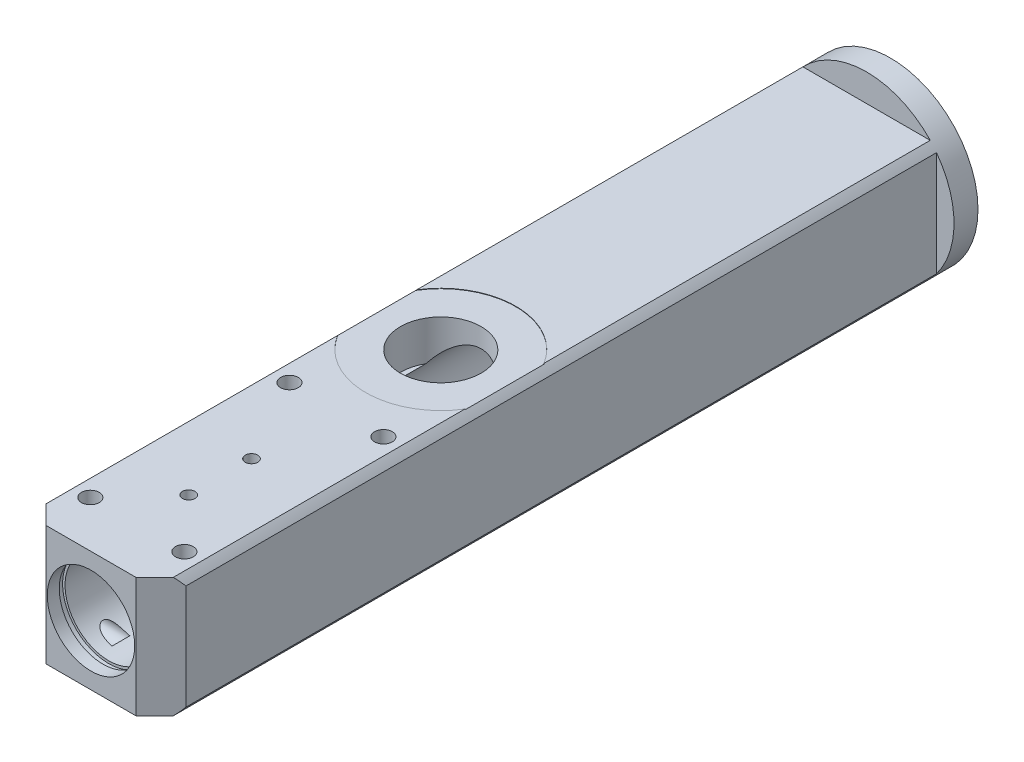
ISO-10303-21;
HEADER;
FILE_DESCRIPTION(('STEP AP214'),'2;1');
FILE_NAME('part.step','',(''),(''),'','','');
FILE_SCHEMA(('AUTOMOTIVE_DESIGN { 1 0 10303 214 1 1 1 1 }'));
ENDSEC;
DATA;
#1=APPLICATION_CONTEXT('core data for automotive mechanical design processes');
#2=APPLICATION_PROTOCOL_DEFINITION('international standard','automotive_design',2000,#1);
#3=PRODUCT_CONTEXT('',#1,'mechanical');
#4=PRODUCT('Part','Part','',(#3));
#5=PRODUCT_RELATED_PRODUCT_CATEGORY('part','',(#4));
#6=PRODUCT_DEFINITION_FORMATION('','',#4);
#7=PRODUCT_DEFINITION_CONTEXT('part definition',#1,'design');
#8=PRODUCT_DEFINITION('design','',#6,#7);
#9=PRODUCT_DEFINITION_SHAPE('','',#8);
#10=(LENGTH_UNIT() NAMED_UNIT(*) SI_UNIT(.MILLI.,.METRE.));
#11=(NAMED_UNIT(*) PLANE_ANGLE_UNIT() SI_UNIT($,.RADIAN.));
#12=(NAMED_UNIT(*) SI_UNIT($,.STERADIAN.) SOLID_ANGLE_UNIT());
#13=UNCERTAINTY_MEASURE_WITH_UNIT(LENGTH_MEASURE(1.E-05),#10,'distance_accuracy_value','');
#14=(GEOMETRIC_REPRESENTATION_CONTEXT(3) GLOBAL_UNCERTAINTY_ASSIGNED_CONTEXT((#13)) GLOBAL_UNIT_ASSIGNED_CONTEXT((#10,
#11,#12)) REPRESENTATION_CONTEXT('',''));
#15=CARTESIAN_POINT('',(0.,0.,0.));
#16=DIRECTION('',(0.,0.,1.));
#17=DIRECTION('',(1.,0.,0.));
#18=AXIS2_PLACEMENT_3D('',#15,#16,#17);
#19=CARTESIAN_POINT('',(0.,0.,0.));
#20=DIRECTION('',(0.,0.,1.));
#21=DIRECTION('',(1.,0.,0.));
#22=AXIS2_PLACEMENT_3D('',#19,#20,#21);
#23=PLANE('',#22);
#24=CARTESIAN_POINT('',(0.,0.,0.));
#25=DIRECTION('',(0.,0.,-1.));
#26=DIRECTION('',(-1.,0.,0.));
#27=AXIS2_PLACEMENT_3D('',#24,#25,#26);
#28=CIRCLE('',#27,8.89);
#29=CARTESIAN_POINT('',(-8.89,0.,0.));
#30=VERTEX_POINT('',#29);
#31=EDGE_CURVE('E185',#30,#30,#28,.T.);
#32=ORIENTED_EDGE('',*,*,#31,.F.);
#33=EDGE_LOOP('',(#32));
#34=FACE_BOUND('',#33,.T.);
#35=CARTESIAN_POINT('',(0.,0.,0.));
#36=DIRECTION('',(0.,0.,1.));
#37=DIRECTION('',(1.,0.,0.));
#38=AXIS2_PLACEMENT_3D('',#35,#36,#37);
#39=CIRCLE('',#38,11.1125);
#40=CARTESIAN_POINT('',(11.1125,0.,0.));
#41=VERTEX_POINT('',#40);
#42=EDGE_CURVE('E519',#41,#41,#39,.T.);
#43=ORIENTED_EDGE('',*,*,#42,.F.);
#44=EDGE_LOOP('',(#43));
#45=FACE_BOUND('',#44,.T.);
#46=ADVANCED_FACE('F31',(#34,#45),#23,.F.);
#47=CARTESIAN_POINT('',(0.,0.,101.6));
#48=DIRECTION('',(0.,0.,-1.));
#49=DIRECTION('',(-1.,0.,0.));
#50=AXIS2_PLACEMENT_3D('',#47,#48,#49);
#51=CYLINDRICAL_SURFACE('',#50,11.1125);
#52=DIRECTION('',(0.,0.,-1.));
#53=VECTOR('',#52,1.);
#54=CARTESIAN_POINT('',(-8.08846439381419,-7.62000000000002,101.6));
#55=LINE('',#54,#53);
#56=CARTESIAN_POINT('',(-8.08846439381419,-7.62000000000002,99.2265356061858));
#57=VERTEX_POINT('',#56);
#58=CARTESIAN_POINT('',(-8.08846439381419,-7.61999999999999,3.04799999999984));
#59=VERTEX_POINT('',#58);
#60=EDGE_CURVE('E347',#57,#59,#55,.T.);
#61=ORIENTED_EDGE('',*,*,#60,.F.);
#62=CARTESIAN_POINT('',(0.,0.,107.315));
#63=DIRECTION('',(0.707106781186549,0.,-0.707106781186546));
#64=DIRECTION('',(-0.707106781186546,0.,-0.707106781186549));
#65=AXIS2_PLACEMENT_3D('',#62,#63,#64);
#66=ELLIPSE('',#65,15.7154482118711,11.1125);
#67=CARTESIAN_POINT('',(-8.89,-6.66749999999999,98.425));
#68=VERTEX_POINT('',#67);
#69=EDGE_CURVE('E305',#57,#68,#66,.T.);
#70=ORIENTED_EDGE('',*,*,#69,.T.);
#71=DIRECTION('',(0.,0.,-1.));
#72=VECTOR('',#71,1.);
#73=CARTESIAN_POINT('',(-8.89,-6.66749999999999,101.6));
#74=LINE('',#73,#72);
#75=CARTESIAN_POINT('',(-8.89,-6.66749999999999,3.04799999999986));
#76=VERTEX_POINT('',#75);
#77=EDGE_CURVE('E742',#76,#68,#74,.F.);
#78=ORIENTED_EDGE('',*,*,#77,.F.);
#79=CARTESIAN_POINT('',(0.,0.,3.048));
#80=DIRECTION('',(0.,0.,-1.));
#81=DIRECTION('',(-1.,0.,0.));
#82=AXIS2_PLACEMENT_3D('',#79,#80,#81);
#83=CIRCLE('',#82,11.1125);
#84=CARTESIAN_POINT('',(-8.89,6.66749999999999,3.04799999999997));
#85=VERTEX_POINT('',#84);
#86=EDGE_CURVE('E279',#76,#85,#83,.T.);
#87=ORIENTED_EDGE('',*,*,#86,.T.);
#88=DIRECTION('',(0.,0.,-1.));
#89=VECTOR('',#88,1.);
#90=CARTESIAN_POINT('',(-8.89000000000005,6.66749999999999,101.6));
#91=LINE('',#90,#89);
#92=CARTESIAN_POINT('',(-8.89,6.66749999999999,98.425));
#93=VERTEX_POINT('',#92);
#94=EDGE_CURVE('E745',#93,#85,#91,.T.);
#95=ORIENTED_EDGE('',*,*,#94,.F.);
#96=CARTESIAN_POINT('',(0.,0.,107.315));
#97=DIRECTION('',(0.707106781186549,0.,-0.707106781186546));
#98=DIRECTION('',(-0.707106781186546,0.,-0.707106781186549));
#99=AXIS2_PLACEMENT_3D('',#96,#97,#98);
#100=ELLIPSE('',#99,15.7154482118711,11.1125);
#101=CARTESIAN_POINT('',(-8.08846439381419,7.61999999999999,99.2265356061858));
#102=VERTEX_POINT('',#101);
#103=EDGE_CURVE('E303',#93,#102,#100,.T.);
#104=ORIENTED_EDGE('',*,*,#103,.T.);
#105=DIRECTION('',(0.,0.,-1.));
#106=VECTOR('',#105,1.);
#107=CARTESIAN_POINT('',(-8.08846439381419,7.61999999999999,101.6));
#108=LINE('',#107,#106);
#109=CARTESIAN_POINT('',(-8.0884643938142,7.61999999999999,62.1801459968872));
#110=VERTEX_POINT('',#109);
#111=EDGE_CURVE('E516',#110,#102,#108,.F.);
#112=ORIENTED_EDGE('',*,*,#111,.F.);
#113=CARTESIAN_POINT('',(-8.0884643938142,7.61999999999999,62.1801459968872));
#114=CARTESIAN_POINT('',(-8.09644939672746,7.61152387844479,62.1673061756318));
#115=CARTESIAN_POINT('',(-8.10440510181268,7.60305248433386,62.1544452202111));
#116=CARTESIAN_POINT('',(-8.12025791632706,7.58611915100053,62.1286810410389));
#117=CARTESIAN_POINT('',(-8.12815502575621,7.57765721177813,62.1157778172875));
#118=CARTESIAN_POINT('',(-8.13602283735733,7.5692,62.1028534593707));
#119=B_SPLINE_CURVE_WITH_KNOTS('',3,(#113,#114,#115,#116,#117,#118),.UNSPECIFIED.,.F.,.F.,(4,2,
4),(0.,0.0520015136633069,0.10400302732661),.UNSPECIFIED.);
#120=CARTESIAN_POINT('',(-8.13602283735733,7.5692,62.1028534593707));
#121=VERTEX_POINT('',#120);
#122=EDGE_CURVE('E440',#110,#121,#119,.T.);
#123=ORIENTED_EDGE('',*,*,#122,.T.);
#124=DIRECTION('',(0.,0.,-1.));
#125=VECTOR('',#124,1.);
#126=CARTESIAN_POINT('',(-8.13602283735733,7.5692,101.6));
#127=LINE('',#126,#125);
#128=CARTESIAN_POINT('',(-8.13602283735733,7.5692,52.1971465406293));
#129=VERTEX_POINT('',#128);
#130=EDGE_CURVE('E539',#129,#121,#127,.F.);
#131=ORIENTED_EDGE('',*,*,#130,.F.);
#132=CARTESIAN_POINT('',(-8.13602283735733,7.5692,52.1971465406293));
#133=CARTESIAN_POINT('',(-8.12815502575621,7.57765721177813,52.1842221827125));
#134=CARTESIAN_POINT('',(-8.12025791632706,7.58611915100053,52.1713189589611));
#135=CARTESIAN_POINT('',(-8.10440510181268,7.60305248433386,52.1455547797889));
#136=CARTESIAN_POINT('',(-8.09644939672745,7.61152387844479,52.1326938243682));
#137=CARTESIAN_POINT('',(-8.08846439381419,7.61999999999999,52.1198540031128));
#138=B_SPLINE_CURVE_WITH_KNOTS('',3,(#132,#133,#134,#135,#136,#137),.UNSPECIFIED.,.F.,.F.,(4,2,
4),(0.,0.0520015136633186,0.104003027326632),.UNSPECIFIED.);
#139=CARTESIAN_POINT('',(-8.08846439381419,7.61999999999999,52.1198540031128));
#140=VERTEX_POINT('',#139);
#141=EDGE_CURVE('E454',#129,#140,#138,.T.);
#142=ORIENTED_EDGE('',*,*,#141,.T.);
#143=CARTESIAN_POINT('',(-8.08846439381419,7.61999999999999,3.04799999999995));
#144=VERTEX_POINT('',#143);
#145=EDGE_CURVE('E510',#144,#140,#108,.F.);
#146=ORIENTED_EDGE('',*,*,#145,.F.);
#147=CARTESIAN_POINT('',(0.,0.,3.048));
#148=DIRECTION('',(0.,0.,1.));
#149=DIRECTION('',(1.,0.,0.));
#150=AXIS2_PLACEMENT_3D('',#147,#148,#149);
#151=CIRCLE('',#150,11.1125);
#152=CARTESIAN_POINT('',(8.08846439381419,7.61999999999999,3.048));
#153=VERTEX_POINT('',#152);
#154=EDGE_CURVE('E505',#153,#144,#151,.T.);
#155=ORIENTED_EDGE('',*,*,#154,.F.);
#156=DIRECTION('',(0.,0.,-1.));
#157=VECTOR('',#156,1.);
#158=CARTESIAN_POINT('',(8.08846439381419,7.61999999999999,101.6));
#159=LINE('',#158,#157);
#160=CARTESIAN_POINT('',(8.08846439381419,7.61999999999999,52.1198540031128));
#161=VERTEX_POINT('',#160);
#162=EDGE_CURVE('E509',#161,#153,#159,.T.);
#163=ORIENTED_EDGE('',*,*,#162,.F.);
#164=CARTESIAN_POINT('',(8.08846439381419,7.61999999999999,52.1198540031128));
#165=CARTESIAN_POINT('',(8.09644939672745,7.61152387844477,52.1326938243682));
#166=CARTESIAN_POINT('',(8.10440510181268,7.60305248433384,52.1455547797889));
#167=CARTESIAN_POINT('',(8.12025791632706,7.58611915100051,52.1713189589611));
#168=CARTESIAN_POINT('',(8.12815502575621,7.57765721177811,52.1842221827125));
#169=CARTESIAN_POINT('',(8.13602283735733,7.5692,52.1971465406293));
#170=B_SPLINE_CURVE_WITH_KNOTS('',3,(#164,#165,#166,#167,#168,#169),.UNSPECIFIED.,.F.,.F.,(4,2,
4),(0.,0.0520015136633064,0.104003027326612),.UNSPECIFIED.);
#171=CARTESIAN_POINT('',(8.13602283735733,7.5692,52.1971465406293));
#172=VERTEX_POINT('',#171);
#173=EDGE_CURVE('E449',#161,#172,#170,.T.);
#174=ORIENTED_EDGE('',*,*,#173,.T.);
#175=DIRECTION('',(0.,0.,-1.));
#176=VECTOR('',#175,1.);
#177=CARTESIAN_POINT('',(8.13602283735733,7.5692,101.6));
#178=LINE('',#177,#176);
#179=CARTESIAN_POINT('',(8.13602283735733,7.5692,62.1028534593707));
#180=VERTEX_POINT('',#179);
#181=EDGE_CURVE('E591',#180,#172,#178,.T.);
#182=ORIENTED_EDGE('',*,*,#181,.F.);
#183=CARTESIAN_POINT('',(8.13602283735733,7.5692,62.1028534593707));
#184=CARTESIAN_POINT('',(8.12815502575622,7.57765721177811,62.1157778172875));
#185=CARTESIAN_POINT('',(8.12025791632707,7.5861191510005,62.1286810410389));
#186=CARTESIAN_POINT('',(8.10440510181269,7.60305248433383,62.1544452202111));
#187=CARTESIAN_POINT('',(8.09644939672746,7.61152387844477,62.1673061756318));
#188=CARTESIAN_POINT('',(8.08846439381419,7.61999999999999,62.1801459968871));
#189=B_SPLINE_CURVE_WITH_KNOTS('',3,(#183,#184,#185,#186,#187,#188),.UNSPECIFIED.,.F.,.F.,(4,2,
4),(0.,0.0520015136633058,0.104003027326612),.UNSPECIFIED.);
#190=CARTESIAN_POINT('',(8.0884643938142,7.61999999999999,62.1801459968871));
#191=VERTEX_POINT('',#190);
#192=EDGE_CURVE('E459',#180,#191,#189,.T.);
#193=ORIENTED_EDGE('',*,*,#192,.T.);
#194=CARTESIAN_POINT('',(8.08846439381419,7.61999999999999,99.2265356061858));
#195=VERTEX_POINT('',#194);
#196=EDGE_CURVE('E523',#195,#191,#159,.T.);
#197=ORIENTED_EDGE('',*,*,#196,.F.);
#198=CARTESIAN_POINT('',(0.,0.,107.315));
#199=DIRECTION('',(-0.707106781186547,0.,-0.707106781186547));
#200=DIRECTION('',(0.707106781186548,0.,-0.707106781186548));
#201=AXIS2_PLACEMENT_3D('',#198,#199,#200);
#202=ELLIPSE('',#201,15.715448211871,11.1125);
#203=CARTESIAN_POINT('',(8.89,6.66749999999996,98.425));
#204=VERTEX_POINT('',#203);
#205=EDGE_CURVE('E301',#195,#204,#202,.T.);
#206=ORIENTED_EDGE('',*,*,#205,.T.);
#207=DIRECTION('',(0.,0.,-1.));
#208=VECTOR('',#207,1.);
#209=CARTESIAN_POINT('',(8.89,6.6674999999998,101.6));
#210=LINE('',#209,#208);
#211=CARTESIAN_POINT('',(8.89,6.66749999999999,3.048));
#212=VERTEX_POINT('',#211);
#213=EDGE_CURVE('E318',#212,#204,#210,.F.);
#214=ORIENTED_EDGE('',*,*,#213,.F.);
#215=CARTESIAN_POINT('',(8.89,-6.66749999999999,3.048));
#216=VERTEX_POINT('',#215);
#217=EDGE_CURVE('E282',#212,#216,#83,.T.);
#218=ORIENTED_EDGE('',*,*,#217,.T.);
#219=DIRECTION('',(0.,0.,-1.));
#220=VECTOR('',#219,1.);
#221=CARTESIAN_POINT('',(8.89,-6.66750000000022,101.6));
#222=LINE('',#221,#220);
#223=CARTESIAN_POINT('',(8.89,-6.66750000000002,98.425));
#224=VERTEX_POINT('',#223);
#225=EDGE_CURVE('E315',#224,#216,#222,.T.);
#226=ORIENTED_EDGE('',*,*,#225,.F.);
#227=CARTESIAN_POINT('',(0.,0.,107.315));
#228=DIRECTION('',(-0.707106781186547,0.,-0.707106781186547));
#229=DIRECTION('',(0.707106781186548,0.,-0.707106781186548));
#230=AXIS2_PLACEMENT_3D('',#227,#228,#229);
#231=ELLIPSE('',#230,15.715448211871,11.1125);
#232=CARTESIAN_POINT('',(8.0884643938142,-7.62000000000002,99.2265356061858));
#233=VERTEX_POINT('',#232);
#234=EDGE_CURVE('E299',#224,#233,#231,.T.);
#235=ORIENTED_EDGE('',*,*,#234,.T.);
#236=DIRECTION('',(0.,0.,-1.));
#237=VECTOR('',#236,1.);
#238=CARTESIAN_POINT('',(8.08846439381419,-7.62000000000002,101.6));
#239=LINE('',#238,#237);
#240=CARTESIAN_POINT('',(8.08846439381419,-7.61999999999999,3.048));
#241=VERTEX_POINT('',#240);
#242=EDGE_CURVE('E335',#241,#233,#239,.F.);
#243=ORIENTED_EDGE('',*,*,#242,.F.);
#244=CARTESIAN_POINT('',(0.,0.,3.048));
#245=DIRECTION('',(0.,0.,-1.));
#246=DIRECTION('',(-1.,0.,0.));
#247=AXIS2_PLACEMENT_3D('',#244,#245,#246);
#248=CIRCLE('',#247,11.1125);
#249=EDGE_CURVE('E276',#241,#59,#248,.T.);
#250=ORIENTED_EDGE('',*,*,#249,.T.);
#251=EDGE_LOOP('',(#61,#70,#78,#87,#95,#104,#112,#123,#131,#142,#146,#155,#163,#174,#182,#193,
#197,#206,#214,#218,#226,#235,#243,#250));
#252=FACE_BOUND('',#251,.T.);
#253=ORIENTED_EDGE('',*,*,#42,.T.);
#254=EDGE_LOOP('',(#253));
#255=FACE_BOUND('',#254,.T.);
#256=ADVANCED_FACE('F325',(#252,#255),#51,.T.);
#257=CARTESIAN_POINT('',(0.,0.,101.6));
#258=DIRECTION('',(0.,0.,1.));
#259=DIRECTION('',(1.,0.,0.));
#260=AXIS2_PLACEMENT_3D('',#257,#258,#259);
#261=PLANE('',#260);
#262=DIRECTION('',(1.,0.,0.));
#263=VECTOR('',#262,1.);
#264=CARTESIAN_POINT('',(0.,7.61999999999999,101.6));
#265=LINE('',#264,#263);
#266=CARTESIAN_POINT('',(-5.715,7.61999999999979,101.6));
#267=VERTEX_POINT('',#266);
#268=CARTESIAN_POINT('',(5.71499999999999,7.61999999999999,101.6));
#269=VERTEX_POINT('',#268);
#270=EDGE_CURVE('E342',#267,#269,#265,.T.);
#271=ORIENTED_EDGE('',*,*,#270,.F.);
#272=DIRECTION('',(0.,-1.,0.));
#273=VECTOR('',#272,1.);
#274=CARTESIAN_POINT('',(-5.71499999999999,-2.22044604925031E-13,101.6));
#275=LINE('',#274,#273);
#276=CARTESIAN_POINT('',(-5.715,-7.62000000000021,101.6));
#277=VERTEX_POINT('',#276);
#278=EDGE_CURVE('E292',#267,#277,#275,.T.);
#279=ORIENTED_EDGE('',*,*,#278,.T.);
#280=DIRECTION('',(1.,0.,0.));
#281=VECTOR('',#280,1.);
#282=CARTESIAN_POINT('',(0.,-7.62000000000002,101.6));
#283=LINE('',#282,#281);
#284=CARTESIAN_POINT('',(5.715,-7.62000000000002,101.6));
#285=VERTEX_POINT('',#284);
#286=EDGE_CURVE('E271',#277,#285,#283,.T.);
#287=ORIENTED_EDGE('',*,*,#286,.T.);
#288=DIRECTION('',(0.,1.,0.));
#289=VECTOR('',#288,1.);
#290=CARTESIAN_POINT('',(5.715,0.,101.6));
#291=LINE('',#290,#289);
#292=EDGE_CURVE('E289',#285,#269,#291,.T.);
#293=ORIENTED_EDGE('',*,*,#292,.T.);
#294=EDGE_LOOP('',(#271,#279,#287,#293));
#295=FACE_BOUND('',#294,.T.);
#296=CARTESIAN_POINT('',(0.,0.,101.6));
#297=DIRECTION('',(0.,0.,1.));
#298=DIRECTION('',(1.,0.,0.));
#299=AXIS2_PLACEMENT_3D('',#296,#297,#298);
#300=CIRCLE('',#299,5.55625);
#301=CARTESIAN_POINT('',(5.55624999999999,0.,101.6));
#302=VERTEX_POINT('',#301);
#303=EDGE_CURVE('E908',#302,#302,#300,.T.);
#304=ORIENTED_EDGE('',*,*,#303,.F.);
#305=EDGE_LOOP('',(#304));
#306=FACE_BOUND('',#305,.T.);
#307=ADVANCED_FACE('F338',(#295,#306),#261,.T.);
#308=CARTESIAN_POINT('',(0.,1.26999999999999,89.1794));
#309=DIRECTION('',(0.,1.,0.));
#310=DIRECTION('',(0.,0.,1.));
#311=AXIS2_PLACEMENT_3D('',#308,#309,#310);
#312=CYLINDRICAL_SURFACE('',#311,0.793749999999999);
#313=CARTESIAN_POINT('',(0.,7.61999999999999,89.1794));
#314=DIRECTION('',(0.,1.,0.));
#315=DIRECTION('',(0.,0.,1.));
#316=AXIS2_PLACEMENT_3D('',#313,#314,#315);
#317=CIRCLE('',#316,0.793749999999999);
#318=CARTESIAN_POINT('',(0.,7.61999999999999,89.97315));
#319=VERTEX_POINT('',#318);
#320=EDGE_CURVE('E546',#319,#319,#317,.T.);
#321=ORIENTED_EDGE('',*,*,#320,.T.);
#322=EDGE_LOOP('',(#321));
#323=FACE_BOUND('',#322,.T.);
#324=DIRECTION('',(0.,1.,0.));
#325=VECTOR('',#324,1.);
#326=CARTESIAN_POINT('',(0.10020130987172,1.26999999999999,88.392));
#327=LINE('',#326,#325);
#328=CARTESIAN_POINT('',(0.10020130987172,2.37914086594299,88.392));
#329=VERTEX_POINT('',#328);
#330=CARTESIAN_POINT('',(0.10020130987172,1.26999999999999,88.392));
#331=VERTEX_POINT('',#330);
#332=EDGE_CURVE('E919',#329,#331,#327,.F.);
#333=ORIENTED_EDGE('',*,*,#332,.F.);
#334=CARTESIAN_POINT('',(0.10020130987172,2.37914086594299,88.392));
#335=CARTESIAN_POINT('',(0.143915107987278,2.3773385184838,88.3975240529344));
#336=CARTESIAN_POINT('',(0.18705734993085,2.37427705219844,88.4067480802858));
#337=CARTESIAN_POINT('',(0.270960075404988,2.3661476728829,88.4320596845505));
#338=CARTESIAN_POINT('',(0.31172664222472,2.36108516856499,88.448128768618));
#339=CARTESIAN_POINT('',(0.389858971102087,2.34945448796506,88.4866158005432));
#340=CARTESIAN_POINT('',(0.427227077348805,2.3428873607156,88.509029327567));
#341=CARTESIAN_POINT('',(0.497725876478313,2.32892901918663,88.5595698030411));
#342=CARTESIAN_POINT('',(0.530854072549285,2.32153732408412,88.5877000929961));
#343=CARTESIAN_POINT('',(0.593089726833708,2.30643823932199,88.6499805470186));
#344=CARTESIAN_POINT('',(0.622029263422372,2.29872845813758,88.6842981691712));
#345=CARTESIAN_POINT('',(0.673786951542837,2.28409453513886,88.757432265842));
#346=CARTESIAN_POINT('',(0.696604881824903,2.27717042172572,88.796248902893));
#347=CARTESIAN_POINT('',(0.735508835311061,2.26490581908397,88.8775645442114));
#348=CARTESIAN_POINT('',(0.751567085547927,2.25957188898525,88.9200778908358));
#349=CARTESIAN_POINT('',(0.77622254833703,2.25122239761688,89.0074274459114));
#350=CARTESIAN_POINT('',(0.78482323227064,2.24820575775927,89.0522625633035));
#351=CARTESIAN_POINT('',(0.793980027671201,2.24498760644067,89.140580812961));
#352=CARTESIAN_POINT('',(0.794915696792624,2.24465328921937,89.1840199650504));
#353=CARTESIAN_POINT('',(0.789701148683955,2.24649308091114,89.270413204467));
#354=CARTESIAN_POINT('',(0.783551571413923,2.24866696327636,89.3133673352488));
#355=CARTESIAN_POINT('',(0.764646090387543,2.25516367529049,89.3964901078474));
#356=CARTESIAN_POINT('',(0.752057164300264,2.25943208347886,89.4367013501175));
#357=CARTESIAN_POINT('',(0.720786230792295,2.26960076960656,89.5144571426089));
#358=CARTESIAN_POINT('',(0.702102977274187,2.2755013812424,89.5520011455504));
#359=CARTESIAN_POINT('',(0.65830683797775,2.28856391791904,89.6249945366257));
#360=CARTESIAN_POINT('',(0.632966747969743,2.29576684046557,89.6603001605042));
#361=CARTESIAN_POINT('',(0.576914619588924,2.31048904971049,89.7262854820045));
#362=CARTESIAN_POINT('',(0.54620106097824,2.31800842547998,89.7569638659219));
#363=CARTESIAN_POINT('',(0.478707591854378,2.33290228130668,89.8141569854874));
#364=CARTESIAN_POINT('',(0.441724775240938,2.34025689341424,89.8404382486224));
#365=CARTESIAN_POINT('',(0.363644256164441,2.35365266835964,89.8864030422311));
#366=CARTESIAN_POINT('',(0.322547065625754,2.35969399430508,89.9060873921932));
#367=CARTESIAN_POINT('',(0.23808926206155,2.36969219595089,89.937920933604));
#368=CARTESIAN_POINT('',(0.19477876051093,2.3736826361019,89.9501920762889));
#369=CARTESIAN_POINT('',(0.106562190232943,2.37927432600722,89.9672451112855));
#370=CARTESIAN_POINT('',(0.0616566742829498,2.38087639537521,89.9720295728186));
#371=CARTESIAN_POINT('',(-0.0262280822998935,2.38149226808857,89.9738764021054));
#372=CARTESIAN_POINT('',(-0.0691995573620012,2.38062322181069,89.9712882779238));
#373=CARTESIAN_POINT('',(-0.154055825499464,2.37664104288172,89.9592347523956));
#374=CARTESIAN_POINT('',(-0.195940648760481,2.37352797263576,89.949769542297));
#375=CARTESIAN_POINT('',(-0.277198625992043,2.36541130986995,89.9243837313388));
#376=CARTESIAN_POINT('',(-0.316586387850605,2.36042018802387,89.9085056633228));
#377=CARTESIAN_POINT('',(-0.392177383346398,2.34904476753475,89.8707907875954));
#378=CARTESIAN_POINT('',(-0.428379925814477,2.34266016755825,89.8489526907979));
#379=CARTESIAN_POINT('',(-0.498215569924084,2.32883095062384,89.7988702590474));
#380=CARTESIAN_POINT('',(-0.531676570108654,2.3213530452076,89.7703951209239));
#381=CARTESIAN_POINT('',(-0.593456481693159,2.30633340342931,89.7083298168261));
#382=CARTESIAN_POINT('',(-0.621773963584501,2.29879164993,89.6747382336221));
#383=CARTESIAN_POINT('',(-0.673381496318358,2.28421821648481,89.6020653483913));
#384=CARTESIAN_POINT('',(-0.696477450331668,2.27721119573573,89.562840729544));
#385=CARTESIAN_POINT('',(-0.735701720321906,2.26484440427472,89.4808089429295));
#386=CARTESIAN_POINT('',(-0.751831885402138,2.25948419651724,89.4380027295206));
#387=CARTESIAN_POINT('',(-0.776181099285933,2.25123443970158,89.3513019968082));
#388=CARTESIAN_POINT('',(-0.784614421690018,2.24827823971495,89.3074742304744));
#389=CARTESIAN_POINT('',(-0.794012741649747,2.24497698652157,89.2189340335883));
#390=CARTESIAN_POINT('',(-0.794980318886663,2.24463103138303,89.1742219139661));
#391=CARTESIAN_POINT('',(-0.78954961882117,2.24654602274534,89.0874922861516));
#392=CARTESIAN_POINT('',(-0.783505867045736,2.24868150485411,89.0454491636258));
#393=CARTESIAN_POINT('',(-0.764855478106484,2.25509284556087,88.9630175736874));
#394=CARTESIAN_POINT('',(-0.752248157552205,2.25936892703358,88.9226292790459));
#395=CARTESIAN_POINT('',(-0.720731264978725,2.26961968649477,88.8441503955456));
#396=CARTESIAN_POINT('',(-0.70175919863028,2.27561111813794,88.8060871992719));
#397=CARTESIAN_POINT('',(-0.658093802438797,2.28862004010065,88.7335937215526));
#398=CARTESIAN_POINT('',(-0.633399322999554,2.29563773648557,88.6991641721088));
#399=CARTESIAN_POINT('',(-0.577471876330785,2.31035826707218,88.6330141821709));
#400=CARTESIAN_POINT('',(-0.545965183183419,2.31807774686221,88.6015285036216));
#401=CARTESIAN_POINT('',(-0.478046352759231,2.33303036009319,88.5441941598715));
#402=CARTESIAN_POINT('',(-0.441631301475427,2.34026320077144,88.5183488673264));
#403=CARTESIAN_POINT('',(-0.364176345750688,2.35357112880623,88.4726679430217));
#404=CARTESIAN_POINT('',(-0.323070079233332,2.35962515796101,88.4529384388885));
#405=CARTESIAN_POINT('',(-0.237936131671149,2.36971711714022,88.4207931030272));
#406=CARTESIAN_POINT('',(-0.193916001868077,2.37376004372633,88.4083591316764));
#407=CARTESIAN_POINT('',(-0.132910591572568,2.37759532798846,88.396680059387));
#408=CARTESIAN_POINT('',(-0.11658835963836,2.37845411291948,88.3940810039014));
#409=CARTESIAN_POINT('',(-0.100201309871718,2.37914086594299,88.392));
#410=B_SPLINE_CURVE_WITH_KNOTS('',3,(#334,#335,#336,#337,#338,#339,#340,#341,#342,#343,#344,
#345,#346,#347,#348,#349,#350,#351,#352,#353,#354,#355,#356,#357,#358,#359,#360,#361,#362,#363,
#364,#365,#366,#367,#368,#369,#370,#371,#372,#373,#374,#375,#376,#377,#378,#379,#380,#381,#382,
#383,#384,#385,#386,#387,#388,#389,#390,#391,#392,#393,#394,#395,#396,#397,#398,#399,#400,#401,
#402,#403,#404,#405,#406,#407,#408,#409),.UNSPECIFIED.,.F.,.F.,(4,2,2,2,2,2,2,2,2,2,2,2,2,2,2,2,
2,2,2,2,2,2,2,2,2,2,2,2,2,2,2,2,2,2,2,2,2,4),(0.,0.13205149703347,0.26374847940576,
0.395353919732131,0.527036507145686,0.663046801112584,0.799062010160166,0.935630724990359,
1.07213583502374,1.20183790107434,1.33152825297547,1.45801432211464,1.58452626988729,
1.71609644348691,1.84770390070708,1.98492612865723,2.12213130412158,2.25701313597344,
2.39184866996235,2.52039997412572,2.64894770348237,2.77665649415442,2.90439292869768,
3.03750165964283,3.17064732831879,3.30813563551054,3.44558742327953,3.57908429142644,
3.71253502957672,3.83952152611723,3.96652124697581,4.09480634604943,4.22311723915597,
4.35811641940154,4.49319610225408,4.63050325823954,4.76746755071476,4.81708082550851),.UNSPECIFIED.);
#411=CARTESIAN_POINT('',(-0.100201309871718,2.37914086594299,88.392));
#412=VERTEX_POINT('',#411);
#413=EDGE_CURVE('E380',#329,#412,#410,.T.);
#414=ORIENTED_EDGE('',*,*,#413,.T.);
#415=DIRECTION('',(0.,1.,0.));
#416=VECTOR('',#415,1.);
#417=CARTESIAN_POINT('',(-0.100201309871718,1.26999999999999,88.392));
#418=LINE('',#417,#416);
#419=CARTESIAN_POINT('',(-0.100201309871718,1.26999999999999,88.392));
#420=VERTEX_POINT('',#419);
#421=EDGE_CURVE('E390',#420,#412,#418,.T.);
#422=ORIENTED_EDGE('',*,*,#421,.F.);
#423=CARTESIAN_POINT('',(0.,1.26999999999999,89.1794));
#424=DIRECTION('',(0.,1.,0.));
#425=DIRECTION('',(0.,0.,1.));
#426=AXIS2_PLACEMENT_3D('',#423,#424,#425);
#427=CIRCLE('',#426,0.793749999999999);
#428=EDGE_CURVE('E568',#331,#420,#427,.T.);
#429=ORIENTED_EDGE('',*,*,#428,.F.);
#430=EDGE_LOOP('',(#333,#414,#422,#429));
#431=FACE_BOUND('',#430,.T.);
#432=ADVANCED_FACE('F392',(#323,#431),#312,.F.);
#433=CARTESIAN_POINT('',(0.,1.26999999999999,89.1794));
#434=DIRECTION('',(0.,1.,0.));
#435=DIRECTION('',(0.,0.,1.));
#436=AXIS2_PLACEMENT_3D('',#433,#434,#435);
#437=PLANE('',#436);
#438=ORIENTED_EDGE('',*,*,#428,.T.);
#439=DIRECTION('',(1.,0.,0.));
#440=VECTOR('',#439,1.);
#441=CARTESIAN_POINT('',(0.,1.26999999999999,88.392));
#442=LINE('',#441,#440);
#443=EDGE_CURVE('E535',#420,#331,#442,.T.);
#444=ORIENTED_EDGE('',*,*,#443,.T.);
#445=EDGE_LOOP('',(#438,#444));
#446=FACE_BOUND('',#445,.T.);
#447=ADVANCED_FACE('F557',(#446),#437,.T.);
#448=CARTESIAN_POINT('',(13.5551981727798,7.61999999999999,69.85));
#449=DIRECTION('',(0.,1.,0.));
#450=DIRECTION('',(0.,0.,1.));
#451=AXIS2_PLACEMENT_3D('',#448,#449,#450);
#452=PLANE('',#451);
#453=CARTESIAN_POINT('',(0.,7.61999999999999,57.15));
#454=DIRECTION('',(0.,1.,0.));
#455=DIRECTION('',(0.,0.,1.));
#456=AXIS2_PLACEMENT_3D('',#453,#454,#455);
#457=CIRCLE('',#456,9.525);
#458=EDGE_CURVE('E588',#161,#140,#457,.T.);
#459=ORIENTED_EDGE('',*,*,#458,.F.);
#460=ORIENTED_EDGE('',*,*,#162,.T.);
#461=DIRECTION('',(-1.,0.,0.));
#462=VECTOR('',#461,1.);
#463=CARTESIAN_POINT('',(-13.4688593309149,7.61999999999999,3.04799999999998));
#464=LINE('',#463,#462);
#465=EDGE_CURVE('E507',#153,#144,#464,.T.);
#466=ORIENTED_EDGE('',*,*,#465,.T.);
#467=ORIENTED_EDGE('',*,*,#145,.T.);
#468=EDGE_LOOP('',(#459,#460,#466,#467));
#469=FACE_BOUND('',#468,.T.);
#470=ADVANCED_FACE('F486',(#469),#452,.T.);
#471=CARTESIAN_POINT('',(0.,2.53999999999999,57.15));
#472=DIRECTION('',(0.,1.,0.));
#473=DIRECTION('',(0.,0.,1.));
#474=AXIS2_PLACEMENT_3D('',#471,#472,#473);
#475=CYLINDRICAL_SURFACE('',#474,5.1308);
#476=CARTESIAN_POINT('',(0.,2.53999999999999,57.15));
#477=DIRECTION('',(0.,1.,0.));
#478=DIRECTION('',(0.,0.,1.));
#479=AXIS2_PLACEMENT_3D('',#476,#477,#478);
#480=CIRCLE('',#479,5.1308);
#481=CARTESIAN_POINT('',(-4.45797135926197,2.53999999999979,54.61));
#482=VERTEX_POINT('',#481);
#483=CARTESIAN_POINT('',(-4.45797135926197,2.53999999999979,59.69));
#484=VERTEX_POINT('',#483);
#485=EDGE_CURVE('E607',#482,#484,#480,.T.);
#486=ORIENTED_EDGE('',*,*,#485,.F.);
#487=CARTESIAN_POINT('',(0.,0.,57.15));
#488=DIRECTION('',(0.,-0.707106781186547,-0.707106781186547));
#489=DIRECTION('',(0.,0.707106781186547,-0.707106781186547));
#490=AXIS2_PLACEMENT_3D('',#487,#488,#489);
#491=ELLIPSE('',#490,7.25604694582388,5.1308);
#492=CARTESIAN_POINT('',(4.45797135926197,2.53999999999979,54.61));
#493=VERTEX_POINT('',#492);
#494=EDGE_CURVE('E527',#493,#482,#491,.F.);
#495=ORIENTED_EDGE('',*,*,#494,.F.);
#496=CARTESIAN_POINT('',(4.45797135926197,2.53999999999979,59.69));
#497=VERTEX_POINT('',#496);
#498=EDGE_CURVE('E604',#497,#493,#480,.T.);
#499=ORIENTED_EDGE('',*,*,#498,.F.);
#500=CARTESIAN_POINT('',(0.,0.,57.15));
#501=DIRECTION('',(0.,0.707106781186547,-0.707106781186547));
#502=DIRECTION('',(0.,-0.707106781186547,-0.707106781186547));
#503=AXIS2_PLACEMENT_3D('',#500,#501,#502);
#504=ELLIPSE('',#503,7.25604694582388,5.1308);
#505=EDGE_CURVE('E530',#484,#497,#504,.T.);
#506=ORIENTED_EDGE('',*,*,#505,.F.);
#507=EDGE_LOOP('',(#486,#495,#499,#506));
#508=FACE_BOUND('',#507,.T.);
#509=CARTESIAN_POINT('',(0.,7.5692,57.15));
#510=DIRECTION('',(0.,1.,0.));
#511=DIRECTION('',(0.,0.,1.));
#512=AXIS2_PLACEMENT_3D('',#509,#510,#511);
#513=CIRCLE('',#512,5.1308);
#514=CARTESIAN_POINT('',(0.,7.5692,62.2808));
#515=VERTEX_POINT('',#514);
#516=EDGE_CURVE('E536',#515,#515,#513,.F.);
#517=ORIENTED_EDGE('',*,*,#516,.F.);
#518=EDGE_LOOP('',(#517));
#519=FACE_BOUND('',#518,.T.);
#520=ADVANCED_FACE('F482',(#508,#519),#475,.F.);
#521=CARTESIAN_POINT('',(0.,0.,63.5));
#522=DIRECTION('',(0.,0.,-1.));
#523=DIRECTION('',(-1.,0.,0.));
#524=AXIS2_PLACEMENT_3D('',#521,#522,#523);
#525=CYLINDRICAL_SURFACE('',#524,5.1308);
#526=CARTESIAN_POINT('',(0.,0.,63.5));
#527=DIRECTION('',(0.,0.,-1.));
#528=DIRECTION('',(-1.,0.,0.));
#529=AXIS2_PLACEMENT_3D('',#526,#527,#528);
#530=CIRCLE('',#529,5.1308);
#531=CARTESIAN_POINT('',(-5.1308,0.,63.5));
#532=VERTEX_POINT('',#531);
#533=EDGE_CURVE('E601',#532,#532,#530,.T.);
#534=ORIENTED_EDGE('',*,*,#533,.F.);
#535=EDGE_LOOP('',(#534));
#536=FACE_BOUND('',#535,.T.);
#537=DIRECTION('',(0.,0.,-1.));
#538=VECTOR('',#537,1.);
#539=CARTESIAN_POINT('',(4.45797135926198,2.53999999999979,63.5));
#540=LINE('',#539,#538);
#541=EDGE_CURVE('E533',#493,#497,#540,.F.);
#542=ORIENTED_EDGE('',*,*,#541,.F.);
#543=ORIENTED_EDGE('',*,*,#494,.T.);
#544=DIRECTION('',(0.,0.,-1.));
#545=VECTOR('',#544,1.);
#546=CARTESIAN_POINT('',(-4.45797135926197,2.53999999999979,63.5));
#547=LINE('',#546,#545);
#548=EDGE_CURVE('E525',#484,#482,#547,.T.);
#549=ORIENTED_EDGE('',*,*,#548,.F.);
#550=ORIENTED_EDGE('',*,*,#505,.T.);
#551=EDGE_LOOP('',(#542,#543,#549,#550));
#552=FACE_BOUND('',#551,.T.);
#553=CARTESIAN_POINT('',(0.,0.,-2.54000000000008));
#554=DIRECTION('',(0.,0.,-1.));
#555=DIRECTION('',(-1.,0.,0.));
#556=AXIS2_PLACEMENT_3D('',#553,#554,#555);
#557=CIRCLE('',#556,5.1308);
#558=CARTESIAN_POINT('',(-5.1308,0.,-2.54000000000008));
#559=VERTEX_POINT('',#558);
#560=EDGE_CURVE('E755',#559,#559,#557,.T.);
#561=ORIENTED_EDGE('',*,*,#560,.T.);
#562=EDGE_LOOP('',(#561));
#563=FACE_BOUND('',#562,.T.);
#564=ADVANCED_FACE('F485',(#536,#552,#563),#525,.F.);
#565=CARTESIAN_POINT('',(-13.4688593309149,12.7,3.048));
#566=DIRECTION('',(0.,0.,1.));
#567=DIRECTION('',(1.,0.,0.));
#568=AXIS2_PLACEMENT_3D('',#565,#566,#567);
#569=PLANE('',#568);
#570=ORIENTED_EDGE('',*,*,#154,.T.);
#571=ORIENTED_EDGE('',*,*,#465,.F.);
#572=EDGE_LOOP('',(#570,#571));
#573=FACE_BOUND('',#572,.T.);
#574=ADVANCED_FACE('F494',(#573),#569,.T.);
#575=ORIENTED_EDGE('',*,*,#111,.T.);
#576=DIRECTION('',(-0.707106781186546,0.,-0.707106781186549));
#577=VECTOR('',#576,1.);
#578=CARTESIAN_POINT('',(-11.9549009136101,7.61999999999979,95.3600990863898));
#579=LINE('',#578,#577);
#580=EDGE_CURVE('E310',#102,#267,#579,.F.);
#581=ORIENTED_EDGE('',*,*,#580,.T.);
#582=ORIENTED_EDGE('',*,*,#270,.T.);
#583=DIRECTION('',(-0.707106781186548,0.,0.707106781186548));
#584=VECTOR('',#583,1.);
#585=CARTESIAN_POINT('',(25.5100990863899,7.61999999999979,81.8049009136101));
#586=LINE('',#585,#584);
#587=EDGE_CURVE('E308',#269,#195,#586,.F.);
#588=ORIENTED_EDGE('',*,*,#587,.T.);
#589=ORIENTED_EDGE('',*,*,#196,.T.);
#590=EDGE_CURVE('E583',#110,#191,#457,.T.);
#591=ORIENTED_EDGE('',*,*,#590,.F.);
#592=EDGE_LOOP('',(#575,#581,#582,#588,#589,#591));
#593=FACE_BOUND('',#592,.T.);
#594=CARTESIAN_POINT('',(5.96900000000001,7.61999999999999,95.7072));
#595=DIRECTION('',(0.,1.,0.));
#596=DIRECTION('',(0.,0.,-1.));
#597=AXIS2_PLACEMENT_3D('',#594,#595,#596);
#598=CIRCLE('',#597,1.13030000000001);
#599=CARTESIAN_POINT('',(5.96900000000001,7.61999999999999,94.5769));
#600=VERTEX_POINT('',#599);
#601=EDGE_CURVE('E359',#600,#600,#598,.T.);
#602=ORIENTED_EDGE('',*,*,#601,.F.);
#603=EDGE_LOOP('',(#602));
#604=FACE_BOUND('',#603,.T.);
#605=CARTESIAN_POINT('',(-5.969,7.61999999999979,95.7072));
#606=DIRECTION('',(0.,1.,0.));
#607=DIRECTION('',(0.,0.,1.));
#608=AXIS2_PLACEMENT_3D('',#605,#606,#607);
#609=CIRCLE('',#608,1.13030000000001);
#610=CARTESIAN_POINT('',(-5.969,7.61999999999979,96.8375));
#611=VERTEX_POINT('',#610);
#612=EDGE_CURVE('E369',#611,#611,#609,.T.);
#613=ORIENTED_EDGE('',*,*,#612,.F.);
#614=EDGE_LOOP('',(#613));
#615=FACE_BOUND('',#614,.T.);
#616=ORIENTED_EDGE('',*,*,#320,.F.);
#617=EDGE_LOOP('',(#616));
#618=FACE_BOUND('',#617,.T.);
#619=CARTESIAN_POINT('',(0.,7.61999999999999,81.2038));
#620=DIRECTION('',(0.,1.,0.));
#621=DIRECTION('',(0.,0.,-1.));
#622=AXIS2_PLACEMENT_3D('',#619,#620,#621);
#623=CIRCLE('',#622,0.793749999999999);
#624=CARTESIAN_POINT('',(0.,7.61999999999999,80.41005));
#625=VERTEX_POINT('',#624);
#626=EDGE_CURVE('E547',#625,#625,#623,.T.);
#627=ORIENTED_EDGE('',*,*,#626,.F.);
#628=EDGE_LOOP('',(#627));
#629=FACE_BOUND('',#628,.T.);
#630=CARTESIAN_POINT('',(-5.969,7.61999999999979,70.4088));
#631=DIRECTION('',(0.,1.,0.));
#632=DIRECTION('',(0.,0.,-1.));
#633=AXIS2_PLACEMENT_3D('',#630,#631,#632);
#634=CIRCLE('',#633,1.13030000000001);
#635=CARTESIAN_POINT('',(-5.969,7.61999999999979,69.2785));
#636=VERTEX_POINT('',#635);
#637=EDGE_CURVE('E363',#636,#636,#634,.T.);
#638=ORIENTED_EDGE('',*,*,#637,.F.);
#639=EDGE_LOOP('',(#638));
#640=FACE_BOUND('',#639,.T.);
#641=CARTESIAN_POINT('',(5.969,7.61999999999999,70.4088));
#642=DIRECTION('',(0.,1.,0.));
#643=DIRECTION('',(0.,0.,1.));
#644=AXIS2_PLACEMENT_3D('',#641,#642,#643);
#645=CIRCLE('',#644,1.13030000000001);
#646=CARTESIAN_POINT('',(5.969,7.61999999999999,71.5391));
#647=VERTEX_POINT('',#646);
#648=EDGE_CURVE('E350',#647,#647,#645,.T.);
#649=ORIENTED_EDGE('',*,*,#648,.F.);
#650=EDGE_LOOP('',(#649));
#651=FACE_BOUND('',#650,.T.);
#652=ADVANCED_FACE('F490',(#593,#604,#615,#618,#629,#640,#651),#452,.T.);
#653=CARTESIAN_POINT('',(0.,0.,63.5));
#654=DIRECTION('',(0.,0.,-1.));
#655=DIRECTION('',(-1.,0.,0.));
#656=AXIS2_PLACEMENT_3D('',#653,#654,#655);
#657=PLANE('',#656);
#658=CARTESIAN_POINT('',(0.,0.,63.5));
#659=DIRECTION('',(0.,0.,-1.));
#660=DIRECTION('',(-1.,0.,0.));
#661=AXIS2_PLACEMENT_3D('',#658,#659,#660);
#662=CIRCLE('',#661,2.38125);
#663=CARTESIAN_POINT('',(-2.38125,0.,63.5));
#664=VERTEX_POINT('',#663);
#665=EDGE_CURVE('E572',#664,#664,#662,.T.);
#666=ORIENTED_EDGE('',*,*,#665,.F.);
#667=EDGE_LOOP('',(#666));
#668=FACE_BOUND('',#667,.T.);
#669=ORIENTED_EDGE('',*,*,#533,.T.);
#670=EDGE_LOOP('',(#669));
#671=FACE_BOUND('',#670,.T.);
#672=ADVANCED_FACE('F480',(#668,#671),#657,.T.);
#673=CARTESIAN_POINT('',(0.,2.53999999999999,57.15));
#674=DIRECTION('',(0.,1.,0.));
#675=DIRECTION('',(0.,0.,1.));
#676=AXIS2_PLACEMENT_3D('',#673,#674,#675);
#677=PLANE('',#676);
#678=ORIENTED_EDGE('',*,*,#541,.T.);
#679=ORIENTED_EDGE('',*,*,#498,.T.);
#680=EDGE_LOOP('',(#678,#679));
#681=FACE_BOUND('',#680,.T.);
#682=ADVANCED_FACE('F474',(#681),#677,.T.);
#683=ORIENTED_EDGE('',*,*,#548,.T.);
#684=ORIENTED_EDGE('',*,*,#485,.T.);
#685=EDGE_LOOP('',(#683,#684));
#686=FACE_BOUND('',#685,.T.);
#687=ADVANCED_FACE('F470',(#686),#677,.T.);
#688=CARTESIAN_POINT('',(0.,7.5692,57.15));
#689=DIRECTION('',(0.,1.,0.));
#690=DIRECTION('',(0.,0.,1.));
#691=AXIS2_PLACEMENT_3D('',#688,#689,#690);
#692=CYLINDRICAL_SURFACE('',#691,9.525);
#693=CARTESIAN_POINT('',(0.,7.5692,57.15));
#694=DIRECTION('',(0.,1.,0.));
#695=DIRECTION('',(0.,0.,1.));
#696=AXIS2_PLACEMENT_3D('',#693,#694,#695);
#697=CIRCLE('',#696,9.525);
#698=EDGE_CURVE('E585',#121,#180,#697,.T.);
#699=ORIENTED_EDGE('',*,*,#698,.F.);
#700=ORIENTED_EDGE('',*,*,#122,.F.);
#701=ORIENTED_EDGE('',*,*,#590,.T.);
#702=ORIENTED_EDGE('',*,*,#192,.F.);
#703=EDGE_LOOP('',(#699,#700,#701,#702));
#704=FACE_BOUND('',#703,.T.);
#705=ADVANCED_FACE('F464',(#704),#692,.F.);
#706=EDGE_CURVE('E540',#172,#129,#697,.T.);
#707=ORIENTED_EDGE('',*,*,#706,.F.);
#708=ORIENTED_EDGE('',*,*,#173,.F.);
#709=ORIENTED_EDGE('',*,*,#458,.T.);
#710=ORIENTED_EDGE('',*,*,#141,.F.);
#711=EDGE_LOOP('',(#707,#708,#709,#710));
#712=FACE_BOUND('',#711,.T.);
#713=ADVANCED_FACE('F469',(#712),#692,.F.);
#714=CARTESIAN_POINT('',(0.,7.5692,57.15));
#715=DIRECTION('',(0.,1.,0.));
#716=DIRECTION('',(0.,0.,1.));
#717=AXIS2_PLACEMENT_3D('',#714,#715,#716);
#718=PLANE('',#717);
#719=ORIENTED_EDGE('',*,*,#516,.T.);
#720=EDGE_LOOP('',(#719));
#721=FACE_BOUND('',#720,.T.);
#722=ORIENTED_EDGE('',*,*,#181,.T.);
#723=ORIENTED_EDGE('',*,*,#706,.T.);
#724=ORIENTED_EDGE('',*,*,#130,.T.);
#725=ORIENTED_EDGE('',*,*,#698,.T.);
#726=EDGE_LOOP('',(#722,#723,#724,#725));
#727=FACE_BOUND('',#726,.T.);
#728=ADVANCED_FACE('F472',(#721,#727),#718,.T.);
#729=CARTESIAN_POINT('',(0.,0.,82.296));
#730=DIRECTION('',(0.,0.,-1.));
#731=DIRECTION('',(-1.,0.,0.));
#732=AXIS2_PLACEMENT_3D('',#729,#730,#731);
#733=CYLINDRICAL_SURFACE('',#732,2.38125);
#734=CARTESIAN_POINT('',(0.,2.38125,81.99755));
#735=CARTESIAN_POINT('',(0.0433096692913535,2.38125012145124,81.9975502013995));
#736=CARTESIAN_POINT('',(0.0866181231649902,2.38005754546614,81.9939937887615));
#737=CARTESIAN_POINT('',(0.171959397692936,2.37541760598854,81.9799056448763));
#738=CARTESIAN_POINT('',(0.213992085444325,2.37197000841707,81.9693731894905));
#739=CARTESIAN_POINT('',(0.295539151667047,2.36319463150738,81.9417341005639));
#740=CARTESIAN_POINT('',(0.335057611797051,2.35786999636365,81.9246384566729));
#741=CARTESIAN_POINT('',(0.410666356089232,2.3458840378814,81.8844079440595));
#742=CARTESIAN_POINT('',(0.446755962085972,2.33922245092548,81.8612718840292));
#743=CARTESIAN_POINT('',(0.515732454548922,2.32500562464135,81.8087757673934));
#744=CARTESIAN_POINT('',(0.548484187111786,2.3174289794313,81.7792439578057));
#745=CARTESIAN_POINT('',(0.608673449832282,2.30235374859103,81.7151598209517));
#746=CARTESIAN_POINT('',(0.636109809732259,2.29485518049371,81.6806063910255));
#747=CARTESIAN_POINT('',(0.685661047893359,2.28054957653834,81.6062430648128));
#748=CARTESIAN_POINT('',(0.707600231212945,2.27376862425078,81.5663105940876));
#749=CARTESIAN_POINT('',(0.744393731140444,2.26199148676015,81.4830602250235));
#750=CARTESIAN_POINT('',(0.759250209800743,2.25699475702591,81.4397433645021));
#751=CARTESIAN_POINT('',(0.780949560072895,2.24957721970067,81.352490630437));
#752=CARTESIAN_POINT('',(0.788045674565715,2.24707526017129,81.3086248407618));
#753=CARTESIAN_POINT('',(0.79481451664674,2.24469052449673,81.2202593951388));
#754=CARTESIAN_POINT('',(0.794489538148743,2.24480693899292,81.1757599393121));
#755=CARTESIAN_POINT('',(0.786622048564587,2.24757468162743,81.0895502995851));
#756=CARTESIAN_POINT('',(0.779410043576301,2.25010992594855,81.047805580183));
#757=CARTESIAN_POINT('',(0.758512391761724,2.25723972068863,80.9661564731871));
#758=CARTESIAN_POINT('',(0.744825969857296,2.26183451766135,80.9262523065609));
#759=CARTESIAN_POINT('',(0.71115162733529,2.27264841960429,80.8486661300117));
#760=CARTESIAN_POINT('',(0.691065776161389,2.27889249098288,80.8110302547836));
#761=CARTESIAN_POINT('',(0.645230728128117,2.29229093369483,80.739558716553));
#762=CARTESIAN_POINT('',(0.619479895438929,2.29944556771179,80.7057241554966));
#763=CARTESIAN_POINT('',(0.561458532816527,2.31431567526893,80.6409585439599));
#764=CARTESIAN_POINT('',(0.528917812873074,2.32204092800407,80.6102712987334));
#765=CARTESIAN_POINT('',(0.45905703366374,2.33685507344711,80.5547258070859));
#766=CARTESIAN_POINT('',(0.421736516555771,2.34394390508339,80.5298681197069));
#767=CARTESIAN_POINT('',(0.342858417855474,2.35677954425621,80.4864910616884));
#768=CARTESIAN_POINT('',(0.301262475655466,2.36251234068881,80.4680370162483));
#769=CARTESIAN_POINT('',(0.215319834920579,2.37188825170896,80.4384637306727));
#770=CARTESIAN_POINT('',(0.170974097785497,2.3755320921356,80.4273419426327));
#771=CARTESIAN_POINT('',(0.0828546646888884,2.38019928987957,80.4131808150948));
#772=CARTESIAN_POINT('',(0.039139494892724,2.38132938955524,80.4098120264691));
#773=CARTESIAN_POINT('',(-0.0482402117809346,2.38116191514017,80.4103140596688));
#774=CARTESIAN_POINT('',(-0.0919047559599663,2.37986475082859,80.414183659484));
#775=CARTESIAN_POINT('',(-0.176625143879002,2.37505894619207,80.4287919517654));
#776=CARTESIAN_POINT('',(-0.217719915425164,2.37161545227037,80.4393284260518));
#777=CARTESIAN_POINT('',(-0.297541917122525,2.3629290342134,80.4667185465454));
#778=CARTESIAN_POINT('',(-0.336268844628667,2.35768588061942,80.4835729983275));
#779=CARTESIAN_POINT('',(-0.411391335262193,2.34576089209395,80.5236121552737));
#780=CARTESIAN_POINT('',(-0.447698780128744,2.33904484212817,80.5469517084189));
#781=CARTESIAN_POINT('',(-0.51598895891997,2.32493545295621,80.5991166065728));
#782=CARTESIAN_POINT('',(-0.547970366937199,2.31754190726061,80.6279436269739));
#783=CARTESIAN_POINT('',(-0.608212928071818,2.30248498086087,80.6918143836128));
#784=CARTESIAN_POINT('',(-0.636239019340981,2.2948246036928,80.7270810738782));
#785=CARTESIAN_POINT('',(-0.686004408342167,2.28044353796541,80.8019811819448));
#786=CARTESIAN_POINT('',(-0.707743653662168,2.27372285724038,80.8416146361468));
#787=CARTESIAN_POINT('',(-0.744217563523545,2.26204773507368,80.9241404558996));
#788=CARTESIAN_POINT('',(-0.758966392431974,2.25708972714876,80.967026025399));
#789=CARTESIAN_POINT('',(-0.780966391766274,2.24957348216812,81.054875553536));
#790=CARTESIAN_POINT('',(-0.788220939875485,2.24701416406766,81.0998385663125));
#791=CARTESIAN_POINT('',(-0.794763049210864,2.24470800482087,81.1880814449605));
#792=CARTESIAN_POINT('',(-0.794440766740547,2.24482342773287,81.2313291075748));
#793=CARTESIAN_POINT('',(-0.786798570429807,2.24751320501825,81.3171197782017));
#794=CARTESIAN_POINT('',(-0.77947907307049,2.25008741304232,81.3596628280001));
#795=CARTESIAN_POINT('',(-0.758326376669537,2.2573021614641,81.4420326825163));
#796=CARTESIAN_POINT('',(-0.744619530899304,2.26190252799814,81.4818957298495));
#797=CARTESIAN_POINT('',(-0.711183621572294,2.27263641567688,81.5587867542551));
#798=CARTESIAN_POINT('',(-0.691453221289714,2.27877027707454,81.5958140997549));
#799=CARTESIAN_POINT('',(-0.645525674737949,2.29221370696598,81.6677339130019));
#800=CARTESIAN_POINT('',(-0.619083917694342,2.29956289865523,81.702462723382));
#801=CARTESIAN_POINT('',(-0.560897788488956,2.31444289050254,81.7671162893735));
#802=CARTESIAN_POINT('',(-0.529151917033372,2.3219737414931,81.7970396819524));
#803=CARTESIAN_POINT('',(-0.459772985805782,2.3367208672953,81.8524083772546));
#804=CARTESIAN_POINT('',(-0.421958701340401,2.34391344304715,81.8776337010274));
#805=CARTESIAN_POINT('',(-0.3423899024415,2.35685005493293,81.9213424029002));
#806=CARTESIAN_POINT('',(-0.300636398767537,2.36259446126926,81.9398275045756));
#807=CARTESIAN_POINT('',(-0.216291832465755,2.37176877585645,81.9687540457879));
#808=CARTESIAN_POINT('',(-0.17382153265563,2.37529062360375,81.9795179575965));
#809=CARTESIAN_POINT('',(-0.0875668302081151,2.38003085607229,81.9939148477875));
#810=CARTESIAN_POINT('',(-0.0437827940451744,2.381249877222,81.9975497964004));
#811=CARTESIAN_POINT('',(0.,2.38125,81.99755));
#812=B_SPLINE_CURVE_WITH_KNOTS('',3,(#734,#735,#736,#737,#738,#739,#740,#741,#742,#743,#744,
#745,#746,#747,#748,#749,#750,#751,#752,#753,#754,#755,#756,#757,#758,#759,#760,#761,#762,#763,
#764,#765,#766,#767,#768,#769,#770,#771,#772,#773,#774,#775,#776,#777,#778,#779,#780,#781,#782,
#783,#784,#785,#786,#787,#788,#789,#790,#791,#792,#793,#794,#795,#796,#797,#798,#799,#800,#801,
#802,#803,#804,#805,#806,#807,#808,#809,#810,#811),.UNSPECIFIED.,.T.,.F.,(4,2,2,2,2,2,2,2,2,2,2,
2,2,2,2,2,2,2,2,2,2,2,2,2,2,2,2,2,2,2,2,2,2,2,2,2,2,2,4),(0.,0.129767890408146,
0.259549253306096,0.38911424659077,0.518704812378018,0.652340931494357,0.786006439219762,
0.923515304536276,1.06098216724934,1.19381528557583,1.32660734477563,1.45333106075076,
1.58006995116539,1.70884985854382,1.83766700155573,1.9732093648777,2.10876472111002,
2.24566484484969,2.38251737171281,2.51343781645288,2.64433616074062,2.77144287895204,
2.89856580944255,3.02903254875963,3.15953918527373,3.29597561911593,3.43241319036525,
3.56857310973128,3.70467163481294,3.83377809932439,3.96287687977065,4.08952372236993,
4.21619869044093,4.3484011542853,4.4806410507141,4.61803480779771,4.75539340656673,
4.88661518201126,5.01780068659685),.UNSPECIFIED.);
#813=CARTESIAN_POINT('',(0.,2.38125,81.99755));
#814=VERTEX_POINT('',#813);
#815=EDGE_CURVE('E541',#814,#814,#812,.T.);
#816=ORIENTED_EDGE('',*,*,#815,.T.);
#817=EDGE_LOOP('',(#816));
#818=FACE_BOUND('',#817,.T.);
#819=CARTESIAN_POINT('',(0.,0.,82.296));
#820=DIRECTION('',(0.,0.,-1.));
#821=DIRECTION('',(-1.,0.,0.));
#822=AXIS2_PLACEMENT_3D('',#819,#820,#821);
#823=CIRCLE('',#822,2.38125);
#824=CARTESIAN_POINT('',(-2.38124999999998,0.,82.296));
#825=VERTEX_POINT('',#824);
#826=EDGE_CURVE('E575',#825,#825,#823,.T.);
#827=ORIENTED_EDGE('',*,*,#826,.F.);
#828=EDGE_LOOP('',(#827));
#829=FACE_BOUND('',#828,.T.);
#830=ORIENTED_EDGE('',*,*,#665,.T.);
#831=EDGE_LOOP('',(#830));
#832=FACE_BOUND('',#831,.T.);
#833=ADVANCED_FACE('F550',(#818,#829,#832),#733,.F.);
#834=CARTESIAN_POINT('',(0.,0.,82.296));
#835=DIRECTION('',(0.,0.,-1.));
#836=DIRECTION('',(-1.,0.,0.));
#837=AXIS2_PLACEMENT_3D('',#834,#835,#836);
#838=PLANE('',#837);
#839=ORIENTED_EDGE('',*,*,#826,.T.);
#840=EDGE_LOOP('',(#839));
#841=FACE_BOUND('',#840,.T.);
#842=ADVANCED_FACE('F555',(#841),#838,.T.);
#843=CARTESIAN_POINT('',(0.,1.26999999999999,81.2038));
#844=DIRECTION('',(0.,1.,0.));
#845=DIRECTION('',(0.,0.,1.));
#846=AXIS2_PLACEMENT_3D('',#843,#844,#845);
#847=CYLINDRICAL_SURFACE('',#846,0.793749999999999);
#848=ORIENTED_EDGE('',*,*,#626,.T.);
#849=EDGE_LOOP('',(#848));
#850=FACE_BOUND('',#849,.T.);
#851=ORIENTED_EDGE('',*,*,#815,.F.);
#852=EDGE_LOOP('',(#851));
#853=FACE_BOUND('',#852,.T.);
#854=ADVANCED_FACE('F552',(#850,#853),#847,.F.);
#855=CARTESIAN_POINT('',(0.,0.,92.456));
#856=DIRECTION('',(0.,0.,1.));
#857=DIRECTION('',(1.,0.,0.));
#858=AXIS2_PLACEMENT_3D('',#855,#856,#857);
#859=CYLINDRICAL_SURFACE('',#858,5.55625);
#860=CARTESIAN_POINT('',(0.,0.,100.076));
#861=DIRECTION('',(0.,0.,1.));
#862=DIRECTION('',(1.,0.,0.));
#863=AXIS2_PLACEMENT_3D('',#860,#861,#862);
#864=CIRCLE('',#863,5.55625);
#865=CARTESIAN_POINT('',(5.55625,0.,100.076));
#866=VERTEX_POINT('',#865);
#867=EDGE_CURVE('E548',#866,#866,#864,.F.);
#868=ORIENTED_EDGE('',*,*,#867,.T.);
#869=EDGE_LOOP('',(#868));
#870=FACE_BOUND('',#869,.T.);
#871=ORIENTED_EDGE('',*,*,#303,.T.);
#872=EDGE_LOOP('',(#871));
#873=FACE_BOUND('',#872,.T.);
#874=ADVANCED_FACE('F194',(#870,#873),#859,.F.);
#875=CARTESIAN_POINT('',(0.,0.,99.3394));
#876=DIRECTION('',(0.,0.,1.));
#877=DIRECTION('',(1.,0.,0.));
#878=AXIS2_PLACEMENT_3D('',#875,#876,#877);
#879=PLANE('',#878);
#880=CARTESIAN_POINT('',(0.,0.,99.3394));
#881=DIRECTION('',(0.,0.,1.));
#882=DIRECTION('',(1.,0.,0.));
#883=AXIS2_PLACEMENT_3D('',#880,#881,#882);
#884=CIRCLE('',#883,5.8674);
#885=CARTESIAN_POINT('',(5.8674,0.,99.3394));
#886=VERTEX_POINT('',#885);
#887=EDGE_CURVE('E918',#886,#886,#884,.T.);
#888=ORIENTED_EDGE('',*,*,#887,.T.);
#889=EDGE_LOOP('',(#888));
#890=FACE_BOUND('',#889,.T.);
#891=CARTESIAN_POINT('',(0.,0.,99.3394));
#892=DIRECTION('',(0.,0.,1.));
#893=DIRECTION('',(1.,0.,0.));
#894=AXIS2_PLACEMENT_3D('',#891,#892,#893);
#895=CIRCLE('',#894,5.55625);
#896=CARTESIAN_POINT('',(5.55625,0.,99.3394));
#897=VERTEX_POINT('',#896);
#898=EDGE_CURVE('E910',#897,#897,#895,.F.);
#899=ORIENTED_EDGE('',*,*,#898,.T.);
#900=EDGE_LOOP('',(#899));
#901=FACE_BOUND('',#900,.T.);
#902=ADVANCED_FACE('F405',(#890,#901),#879,.T.);
#903=CARTESIAN_POINT('',(0.,0.,100.076));
#904=DIRECTION('',(0.,0.,1.));
#905=DIRECTION('',(1.,0.,0.));
#906=AXIS2_PLACEMENT_3D('',#903,#904,#905);
#907=PLANE('',#906);
#908=CARTESIAN_POINT('',(0.,0.,100.076));
#909=DIRECTION('',(0.,0.,1.));
#910=DIRECTION('',(1.,0.,0.));
#911=AXIS2_PLACEMENT_3D('',#908,#909,#910);
#912=CIRCLE('',#911,5.8674);
#913=CARTESIAN_POINT('',(5.8674,0.,100.076));
#914=VERTEX_POINT('',#913);
#915=EDGE_CURVE('E915',#914,#914,#912,.T.);
#916=ORIENTED_EDGE('',*,*,#915,.F.);
#917=EDGE_LOOP('',(#916));
#918=FACE_BOUND('',#917,.T.);
#919=ORIENTED_EDGE('',*,*,#867,.F.);
#920=EDGE_LOOP('',(#919));
#921=FACE_BOUND('',#920,.T.);
#922=ADVANCED_FACE('F408',(#918,#921),#907,.F.);
#923=CARTESIAN_POINT('',(0.,0.,99.3394));
#924=DIRECTION('',(0.,0.,1.));
#925=DIRECTION('',(1.,0.,0.));
#926=AXIS2_PLACEMENT_3D('',#923,#924,#925);
#927=CYLINDRICAL_SURFACE('',#926,5.8674);
#928=ORIENTED_EDGE('',*,*,#887,.F.);
#929=EDGE_LOOP('',(#928));
#930=FACE_BOUND('',#929,.T.);
#931=ORIENTED_EDGE('',*,*,#915,.T.);
#932=EDGE_LOOP('',(#931));
#933=FACE_BOUND('',#932,.T.);
#934=ADVANCED_FACE('F412',(#930,#933),#927,.F.);
#935=CARTESIAN_POINT('',(0.,0.,92.456));
#936=DIRECTION('',(0.,0.,1.));
#937=DIRECTION('',(1.,0.,0.));
#938=AXIS2_PLACEMENT_3D('',#935,#936,#937);
#939=PLANE('',#938);
#940=CARTESIAN_POINT('',(0.,0.,92.456));
#941=DIRECTION('',(0.,0.,1.));
#942=DIRECTION('',(1.,0.,0.));
#943=AXIS2_PLACEMENT_3D('',#940,#941,#942);
#944=CIRCLE('',#943,2.38125);
#945=CARTESIAN_POINT('',(2.38125,0.,92.456));
#946=VERTEX_POINT('',#945);
#947=EDGE_CURVE('E374',#946,#946,#944,.T.);
#948=ORIENTED_EDGE('',*,*,#947,.F.);
#949=EDGE_LOOP('',(#948));
#950=FACE_BOUND('',#949,.T.);
#951=CARTESIAN_POINT('',(0.,0.,92.456));
#952=DIRECTION('',(0.,0.,1.));
#953=DIRECTION('',(1.,0.,0.));
#954=AXIS2_PLACEMENT_3D('',#951,#952,#953);
#955=CIRCLE('',#954,5.55625);
#956=CARTESIAN_POINT('',(5.55625,0.,92.456));
#957=VERTEX_POINT('',#956);
#958=EDGE_CURVE('E909',#957,#957,#955,.T.);
#959=ORIENTED_EDGE('',*,*,#958,.T.);
#960=EDGE_LOOP('',(#959));
#961=FACE_BOUND('',#960,.T.);
#962=ADVANCED_FACE('F415',(#950,#961),#939,.T.);
#963=DIRECTION('',(0.,0.,1.));
#964=VECTOR('',#963,1.);
#965=CARTESIAN_POINT('',(-1.27,-5.40916019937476,92.456));
#966=LINE('',#965,#964);
#967=CARTESIAN_POINT('',(-1.27,-5.40916019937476,97.6502398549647));
#968=VERTEX_POINT('',#967);
#969=CARTESIAN_POINT('',(-1.27,-5.40916019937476,95.3897601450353));
#970=VERTEX_POINT('',#969);
#971=EDGE_CURVE('E12',#968,#970,#966,.F.);
#972=ORIENTED_EDGE('',*,*,#971,.F.);
#973=CARTESIAN_POINT('',(-1.27,-5.40916019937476,97.6502398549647));
#974=CARTESIAN_POINT('',(-1.33032022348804,-5.39499818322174,97.6503814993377));
#975=CARTESIAN_POINT('',(-1.39040183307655,-5.37982677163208,97.6502767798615));
#976=CARTESIAN_POINT('',(-1.51003260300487,-5.34748120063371,97.6493094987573));
#977=CARTESIAN_POINT('',(-1.56958162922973,-5.33030655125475,97.6484467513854));
#978=CARTESIAN_POINT('',(-1.74812223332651,-5.2755617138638,97.6443045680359));
#979=CARTESIAN_POINT('',(-1.8661707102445,-5.23496694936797,97.6394617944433));
#980=CARTESIAN_POINT('',(-2.10527523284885,-5.14363196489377,97.6224584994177));
#981=CARTESIAN_POINT('',(-2.22614487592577,-5.09245957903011,97.6099137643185));
#982=CARTESIAN_POINT('',(-2.40320752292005,-5.01006439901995,97.582214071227));
#983=CARTESIAN_POINT('',(-2.46144206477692,-4.98170397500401,97.5715217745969));
#984=CARTESIAN_POINT('',(-2.57625730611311,-4.92330694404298,97.5465137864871));
#985=CARTESIAN_POINT('',(-2.63283877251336,-4.89327113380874,97.5321998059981));
#986=CARTESIAN_POINT('',(-2.7372532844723,-4.83554306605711,97.5011837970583));
#987=CARTESIAN_POINT('',(-2.78531804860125,-4.80800542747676,97.4849784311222));
#988=CARTESIAN_POINT('',(-2.87952311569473,-4.75218446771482,97.448578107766));
#989=CARTESIAN_POINT('',(-2.92566244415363,-4.7239007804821,97.4283811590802));
#990=CARTESIAN_POINT('',(-3.01488109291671,-4.66745690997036,97.3836518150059));
#991=CARTESIAN_POINT('',(-3.05799314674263,-4.63930015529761,97.3591811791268));
#992=CARTESIAN_POINT('',(-3.14111875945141,-4.58342546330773,97.3050926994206));
#993=CARTESIAN_POINT('',(-3.18113608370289,-4.55570702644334,97.2754812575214));
#994=CARTESIAN_POINT('',(-3.25523333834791,-4.50303521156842,97.2121811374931));
#995=CARTESIAN_POINT('',(-3.28951502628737,-4.47801309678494,97.1787895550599));
#996=CARTESIAN_POINT('',(-3.35360499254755,-4.43021976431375,97.1063699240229));
#997=CARTESIAN_POINT('',(-3.38340736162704,-4.40745153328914,97.0673345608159));
#998=CARTESIAN_POINT('',(-3.43751566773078,-4.36538526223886,96.9831942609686));
#999=CARTESIAN_POINT('',(-3.46176306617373,-4.34612458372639,96.9380320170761));
#1000=CARTESIAN_POINT('',(-3.50288603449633,-4.31305084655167,96.8426202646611));
#1001=CARTESIAN_POINT('',(-3.51977234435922,-4.29922985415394,96.7923783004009));
#1002=CARTESIAN_POINT('',(-3.54355210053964,-4.27964572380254,96.6938681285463));
#1003=CARTESIAN_POINT('',(-3.55131116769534,-4.27318685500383,96.6459499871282));
#1004=CARTESIAN_POINT('',(-3.55930165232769,-4.26653454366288,96.5490687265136));
#1005=CARTESIAN_POINT('',(-3.55953924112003,-4.26633596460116,96.5001064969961));
#1006=CARTESIAN_POINT('',(-3.55302474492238,-4.27176056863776,96.410471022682));
#1007=CARTESIAN_POINT('',(-3.54732088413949,-4.27651069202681,96.3696608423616));
#1008=CARTESIAN_POINT('',(-3.5308180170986,-4.29014594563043,96.2898155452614));
#1009=CARTESIAN_POINT('',(-3.52001908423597,-4.29903101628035,96.2507804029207));
#1010=CARTESIAN_POINT('',(-3.49346779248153,-4.32063592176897,96.174207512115));
#1011=CARTESIAN_POINT('',(-3.47757933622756,-4.33346066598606,96.1367473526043));
#1012=CARTESIAN_POINT('',(-3.44164439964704,-4.3620553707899,96.065112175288));
#1013=CARTESIAN_POINT('',(-3.42159586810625,-4.37782678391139,96.0309387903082));
#1014=CARTESIAN_POINT('',(-3.3663461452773,-4.42056532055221,95.9487544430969));
#1015=CARTESIAN_POINT('',(-3.32877184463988,-4.44901233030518,95.9031042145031));
#1016=CARTESIAN_POINT('',(-3.24747451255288,-4.50870167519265,95.8198184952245));
#1017=CARTESIAN_POINT('',(-3.20373686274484,-4.53995058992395,95.7822026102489));
#1018=CARTESIAN_POINT('',(-3.08676493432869,-4.62073273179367,95.6957580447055));
#1019=CARTESIAN_POINT('',(-3.01039036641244,-4.67099769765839,95.651899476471));
#1020=CARTESIAN_POINT('',(-2.85062037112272,-4.77019977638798,95.5777052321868));
#1021=CARTESIAN_POINT('',(-2.76720909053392,-4.81913354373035,95.5474011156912));
#1022=CARTESIAN_POINT('',(-2.60411882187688,-4.90900008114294,95.4995763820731));
#1023=CARTESIAN_POINT('',(-2.52488493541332,-4.95024573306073,95.4810887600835));
#1024=CARTESIAN_POINT('',(-2.36348129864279,-5.02930995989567,95.4505083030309));
#1025=CARTESIAN_POINT('',(-2.28130901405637,-5.0671254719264,95.4384211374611));
#1026=CARTESIAN_POINT('',(-2.11462245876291,-5.13892385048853,95.4190460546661));
#1027=CARTESIAN_POINT('',(-2.03010460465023,-5.17290039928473,95.4117659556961));
#1028=CARTESIAN_POINT('',(-1.85934637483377,-5.23670225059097,95.400728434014));
#1029=CARTESIAN_POINT('',(-1.77310676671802,-5.26652935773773,95.396969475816));
#1030=CARTESIAN_POINT('',(-1.61744050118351,-5.31610787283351,95.3924199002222));
#1031=CARTESIAN_POINT('',(-1.54827917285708,-5.33666069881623,95.391172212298));
#1032=CARTESIAN_POINT('',(-1.4095145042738,-5.37497376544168,95.3897654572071));
#1033=CARTESIAN_POINT('',(-1.33991461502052,-5.39274630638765,95.3896014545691));
#1034=CARTESIAN_POINT('',(-1.27,-5.40916019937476,95.3897601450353));
#1035=B_SPLINE_CURVE_WITH_KNOTS('',3,(#973,#974,#975,#976,#977,#978,#979,#980,#981,#982,#983,
#984,#985,#986,#987,#988,#989,#990,#991,#992,#993,#994,#995,#996,#997,#998,#999,#1000,#1001,
#1002,#1003,#1004,#1005,#1006,#1007,#1008,#1009,#1010,#1011,#1012,#1013,#1014,#1015,#1016,#1017,
#1018,#1019,#1020,#1021,#1022,#1023,#1024,#1025,#1026,#1027,#1028,#1029,#1030,#1031,#1032,#1033,
#1034),.UNSPECIFIED.,.F.,.F.,(4,2,2,2,2,2,2,2,2,2,2,2,2,2,2,2,2,2,2,2,2,2,2,2,2,2,2,2,2,2,4),
(0.,0.185866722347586,0.371779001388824,0.746175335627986,1.14096417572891,1.33780265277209,
1.53454831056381,1.70755040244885,1.88063901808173,2.05140689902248,2.22196362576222,
2.38353234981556,2.5453123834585,2.70872598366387,2.87190035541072,3.01787701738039,
3.16373390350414,3.28760433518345,3.4114729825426,3.53897765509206,3.66654534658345,
3.86226375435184,4.05845443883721,4.36096225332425,4.66417079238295,4.93743094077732,
5.21093273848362,5.48487827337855,5.75870429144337,5.97512743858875,6.19056423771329),.UNSPECIFIED.);
#1036=EDGE_CURVE('E177',#968,#970,#1035,.T.);
#1037=ORIENTED_EDGE('',*,*,#1036,.T.);
#1038=EDGE_LOOP('',(#972,#1037));
#1039=FACE_BOUND('',#1038,.T.);
#1040=DIRECTION('',(0.,0.,1.));
#1041=VECTOR('',#1040,1.);
#1042=CARTESIAN_POINT('',(5.40916019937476,1.26999999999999,92.456));
#1043=LINE('',#1042,#1041);
#1044=CARTESIAN_POINT('',(5.40916019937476,1.26999999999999,96.689115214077));
#1045=VERTEX_POINT('',#1044);
#1046=CARTESIAN_POINT('',(5.40916019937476,1.26999999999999,94.725284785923));
#1047=VERTEX_POINT('',#1046);
#1048=EDGE_CURVE('E272',#1045,#1047,#1043,.F.);
#1049=ORIENTED_EDGE('',*,*,#1048,.T.);
#1050=CARTESIAN_POINT('',(5.40916019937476,1.26999999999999,94.725284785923));
#1051=CARTESIAN_POINT('',(5.39250530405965,1.34097940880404,94.7348237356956));
#1052=CARTESIAN_POINT('',(5.3744632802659,1.41150341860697,94.745633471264));
#1053=CARTESIAN_POINT('',(5.33573276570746,1.55149451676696,94.7706595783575));
#1054=CARTESIAN_POINT('',(5.3150345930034,1.62095664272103,94.7848885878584));
#1055=CARTESIAN_POINT('',(5.27102559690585,1.75883425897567,94.8177247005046));
#1056=CARTESIAN_POINT('',(5.24769040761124,1.82723199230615,94.8363747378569));
#1057=CARTESIAN_POINT('',(5.19900208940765,1.96147123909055,94.8791096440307));
#1058=CARTESIAN_POINT('',(5.17365254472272,2.02731699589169,94.9031849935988));
#1059=CARTESIAN_POINT('',(5.12661821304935,2.14308540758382,94.9529434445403));
#1060=CARTESIAN_POINT('',(5.10517461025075,2.1936219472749,94.9774119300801));
#1061=CARTESIAN_POINT('',(5.06197288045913,2.29155008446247,95.031856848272));
#1062=CARTESIAN_POINT('',(5.04021480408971,2.33894218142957,95.0618324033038));
#1063=CARTESIAN_POINT('',(4.99704300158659,2.42982205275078,95.1288470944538));
#1064=CARTESIAN_POINT('',(4.97563746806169,2.47325084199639,95.1659732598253));
#1065=CARTESIAN_POINT('',(4.93511197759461,2.5531496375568,95.248142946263));
#1066=CARTESIAN_POINT('',(4.91598378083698,2.58964503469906,95.2931563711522));
#1067=CARTESIAN_POINT('',(4.88933921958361,2.63945567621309,95.3712727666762));
#1068=CARTESIAN_POINT('',(4.88027706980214,2.65614054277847,95.4016946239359));
#1069=CARTESIAN_POINT('',(4.86443380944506,2.68504529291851,95.4651698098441));
#1070=CARTESIAN_POINT('',(4.85765124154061,2.69726802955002,95.4982214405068));
#1071=CARTESIAN_POINT('',(4.84694135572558,2.7164680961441,95.5666019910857));
#1072=CARTESIAN_POINT('',(4.84303875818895,2.72340002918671,95.601947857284));
#1073=CARTESIAN_POINT('',(4.83863526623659,2.73121676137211,95.6735080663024));
#1074=CARTESIAN_POINT('',(4.83813196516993,2.73210583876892,95.7097217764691));
#1075=CARTESIAN_POINT('',(4.84044054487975,2.72801239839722,95.7775849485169));
#1076=CARTESIAN_POINT('',(4.84288553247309,2.72367972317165,95.8092892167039));
#1077=CARTESIAN_POINT('',(4.85025860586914,2.71052794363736,95.8714461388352));
#1078=CARTESIAN_POINT('',(4.85518774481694,2.70170693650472,95.9018982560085));
#1079=CARTESIAN_POINT('',(4.86870834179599,2.67728093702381,95.9687023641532));
#1080=CARTESIAN_POINT('',(4.87792238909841,2.66050120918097,96.0044964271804));
#1081=CARTESIAN_POINT('',(4.89876051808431,2.62193455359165,96.0724900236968));
#1082=CARTESIAN_POINT('',(4.91038863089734,2.60013924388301,96.1046834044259));
#1083=CARTESIAN_POINT('',(4.94098211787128,2.54167913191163,96.1795012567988));
#1084=CARTESIAN_POINT('',(4.96084616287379,2.50281094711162,96.2200215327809));
#1085=CARTESIAN_POINT('',(5.00199880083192,2.41952351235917,96.2939579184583));
#1086=CARTESIAN_POINT('',(5.0232903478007,2.37509257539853,96.3273586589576));
#1087=CARTESIAN_POINT('',(5.0633160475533,2.28838990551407,96.3842221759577));
#1088=CARTESIAN_POINT('',(5.08202754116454,2.24657345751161,96.4084103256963));
#1089=CARTESIAN_POINT('',(5.11910362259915,2.16075898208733,96.4529171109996));
#1090=CARTESIAN_POINT('',(5.13746791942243,2.116759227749,96.4732326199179));
#1091=CARTESIAN_POINT('',(5.17355153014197,2.02697510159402,96.5106407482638));
#1092=CARTESIAN_POINT('',(5.19126848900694,1.98118526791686,96.5277223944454));
#1093=CARTESIAN_POINT('',(5.22576871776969,1.88830980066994,96.559096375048));
#1094=CARTESIAN_POINT('',(5.24255163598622,1.84122368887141,96.573387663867));
#1095=CARTESIAN_POINT('',(5.28784133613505,1.70843032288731,96.609976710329));
#1096=CARTESIAN_POINT('',(5.31514002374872,1.62158847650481,96.6296845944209));
#1097=CARTESIAN_POINT('',(5.35287556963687,1.49019866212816,96.6549286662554));
#1098=CARTESIAN_POINT('',(5.36485948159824,1.44646592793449,96.6625921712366));
#1099=CARTESIAN_POINT('',(5.38779199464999,1.35855501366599,96.6767133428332));
#1100=CARTESIAN_POINT('',(5.39874100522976,1.31437701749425,96.6831714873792));
#1101=CARTESIAN_POINT('',(5.40916019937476,1.26999999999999,96.689115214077));
#1102=B_SPLINE_CURVE_WITH_KNOTS('',3,(#1050,#1051,#1052,#1053,#1054,#1055,#1056,#1057,#1058,
#1059,#1060,#1061,#1062,#1063,#1064,#1065,#1066,#1067,#1068,#1069,#1070,#1071,#1072,#1073,#1074,
#1075,#1076,#1077,#1078,#1079,#1080,#1081,#1082,#1083,#1084,#1085,#1086,#1087,#1088,#1089,#1090,
#1091,#1092,#1093,#1094,#1095,#1096,#1097,#1098,#1099,#1100,#1101),.UNSPECIFIED.,.F.,.F.,(4,2,2,
2,2,2,2,2,2,2,2,2,2,2,2,2,2,2,2,2,2,2,2,2,2,4),(0.,0.220620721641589,0.442069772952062,
0.665764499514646,0.889069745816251,1.0691229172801,1.2491474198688,1.4315199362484,
1.61321113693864,1.72042607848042,1.82757234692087,1.93562794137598,2.0436070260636,
2.13942817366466,2.23528997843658,2.35639422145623,2.47770234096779,2.65537916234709,
2.83343574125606,2.98862959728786,3.14394822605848,3.29978479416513,3.45567964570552,
3.73468638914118,3.87263026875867,4.01051933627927),.UNSPECIFIED.);
#1103=EDGE_CURVE('E264',#1047,#1045,#1102,.T.);
#1104=ORIENTED_EDGE('',*,*,#1103,.T.);
#1105=EDGE_LOOP('',(#1049,#1104));
#1106=FACE_BOUND('',#1105,.T.);
#1107=DIRECTION('',(0.,0.,1.));
#1108=VECTOR('',#1107,1.);
#1109=CARTESIAN_POINT('',(-5.40916019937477,1.2699999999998,92.456));
#1110=LINE('',#1109,#1108);
#1111=CARTESIAN_POINT('',(-5.40916019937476,1.2699999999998,96.689115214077));
#1112=VERTEX_POINT('',#1111);
#1113=CARTESIAN_POINT('',(-5.40916019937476,1.2699999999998,94.725284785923));
#1114=VERTEX_POINT('',#1113);
#1115=EDGE_CURVE('E923',#1112,#1114,#1110,.F.);
#1116=ORIENTED_EDGE('',*,*,#1115,.F.);
#1117=CARTESIAN_POINT('',(-5.40916019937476,1.2699999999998,96.689115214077));
#1118=CARTESIAN_POINT('',(-5.39250530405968,1.34097940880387,96.6795762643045));
#1119=CARTESIAN_POINT('',(-5.37446328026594,1.41150341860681,96.668766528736));
#1120=CARTESIAN_POINT('',(-5.3357327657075,1.5514945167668,96.6437404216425));
#1121=CARTESIAN_POINT('',(-5.31503459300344,1.62095664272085,96.6295114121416));
#1122=CARTESIAN_POINT('',(-5.27102559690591,1.7588342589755,96.5966752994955));
#1123=CARTESIAN_POINT('',(-5.24769040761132,1.82723199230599,96.5780252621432));
#1124=CARTESIAN_POINT('',(-5.19900208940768,1.96147123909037,96.5352903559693));
#1125=CARTESIAN_POINT('',(-5.1736525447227,2.02731699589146,96.5112150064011));
#1126=CARTESIAN_POINT('',(-5.12661821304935,2.14308540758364,96.4614565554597));
#1127=CARTESIAN_POINT('',(-5.10517461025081,2.19362194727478,96.43698806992));
#1128=CARTESIAN_POINT('',(-5.06197288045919,2.29155008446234,96.382543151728));
#1129=CARTESIAN_POINT('',(-5.04021480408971,2.33894218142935,96.3525675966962));
#1130=CARTESIAN_POINT('',(-4.99704300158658,2.4298220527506,96.2855529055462));
#1131=CARTESIAN_POINT('',(-4.97563746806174,2.47325084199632,96.2484267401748));
#1132=CARTESIAN_POINT('',(-4.93511197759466,2.55314963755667,96.1662570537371));
#1133=CARTESIAN_POINT('',(-4.91598378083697,2.58964503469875,96.1212436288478));
#1134=CARTESIAN_POINT('',(-4.88933921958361,2.63945567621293,96.0431272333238));
#1135=CARTESIAN_POINT('',(-4.88027706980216,2.65614054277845,96.0127053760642));
#1136=CARTESIAN_POINT('',(-4.86443380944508,2.68504529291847,95.949230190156));
#1137=CARTESIAN_POINT('',(-4.85765124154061,2.69726802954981,95.9161785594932));
#1138=CARTESIAN_POINT('',(-4.84694135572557,2.71646809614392,95.8477980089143));
#1139=CARTESIAN_POINT('',(-4.84303875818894,2.72340002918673,95.812452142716));
#1140=CARTESIAN_POINT('',(-4.83863526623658,2.7312167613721,95.7408919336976));
#1141=CARTESIAN_POINT('',(-4.83813196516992,2.73210583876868,95.7046782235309));
#1142=CARTESIAN_POINT('',(-4.84044054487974,2.72801239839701,95.6368150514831));
#1143=CARTESIAN_POINT('',(-4.84288553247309,2.72367972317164,95.6051107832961));
#1144=CARTESIAN_POINT('',(-4.85025860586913,2.71052794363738,95.5429538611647));
#1145=CARTESIAN_POINT('',(-4.85518774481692,2.70170693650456,95.5125017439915));
#1146=CARTESIAN_POINT('',(-4.86870834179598,2.67728093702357,95.4456976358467));
#1147=CARTESIAN_POINT('',(-4.87792238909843,2.66050120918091,95.4099035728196));
#1148=CARTESIAN_POINT('',(-4.89876051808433,2.62193455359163,95.3419099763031));
#1149=CARTESIAN_POINT('',(-4.91038863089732,2.60013924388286,95.309716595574));
#1150=CARTESIAN_POINT('',(-4.94098211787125,2.54167913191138,95.2348987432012));
#1151=CARTESIAN_POINT('',(-4.96084616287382,2.50281094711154,95.194378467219));
#1152=CARTESIAN_POINT('',(-5.00199880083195,2.41952351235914,95.1204420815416));
#1153=CARTESIAN_POINT('',(-5.02329034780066,2.3750925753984,95.0870413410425));
#1154=CARTESIAN_POINT('',(-5.06331604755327,2.28838990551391,95.0301778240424));
#1155=CARTESIAN_POINT('',(-5.08202754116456,2.24657345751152,95.0059896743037));
#1156=CARTESIAN_POINT('',(-5.11910362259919,2.16075898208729,94.9614828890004));
#1157=CARTESIAN_POINT('',(-5.13746791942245,2.11675922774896,94.941167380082));
#1158=CARTESIAN_POINT('',(-5.17355153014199,2.02697510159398,94.9037592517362));
#1159=CARTESIAN_POINT('',(-5.19126848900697,1.98118526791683,94.8866776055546));
#1160=CARTESIAN_POINT('',(-5.22576871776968,1.88830980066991,94.855303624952));
#1161=CARTESIAN_POINT('',(-5.24255163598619,1.84122368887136,94.841012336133));
#1162=CARTESIAN_POINT('',(-5.28784133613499,1.70843032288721,94.8044232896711));
#1163=CARTESIAN_POINT('',(-5.31514002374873,1.62158847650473,94.7847154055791));
#1164=CARTESIAN_POINT('',(-5.35287556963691,1.49019866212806,94.7594713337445));
#1165=CARTESIAN_POINT('',(-5.36485948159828,1.44646592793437,94.7518078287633));
#1166=CARTESIAN_POINT('',(-5.38779199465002,1.35855501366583,94.7376866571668));
#1167=CARTESIAN_POINT('',(-5.39874100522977,1.31437701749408,94.7312285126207));
#1168=CARTESIAN_POINT('',(-5.40916019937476,1.2699999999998,94.725284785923));
#1169=B_SPLINE_CURVE_WITH_KNOTS('',3,(#1117,#1118,#1119,#1120,#1121,#1122,#1123,#1124,#1125,
#1126,#1127,#1128,#1129,#1130,#1131,#1132,#1133,#1134,#1135,#1136,#1137,#1138,#1139,#1140,#1141,
#1142,#1143,#1144,#1145,#1146,#1147,#1148,#1149,#1150,#1151,#1152,#1153,#1154,#1155,#1156,#1157,
#1158,#1159,#1160,#1161,#1162,#1163,#1164,#1165,#1166,#1167,#1168),.UNSPECIFIED.,.F.,.F.,(4,2,2,
2,2,2,2,2,2,2,2,2,2,2,2,2,2,2,2,2,2,2,2,2,2,4),(0.,0.220620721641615,0.442069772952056,
0.665764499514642,0.88906974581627,1.06912291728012,1.24914741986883,1.43151993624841,
1.61321113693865,1.72042607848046,1.82757234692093,1.93562794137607,2.04360702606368,
2.13942817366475,2.23528997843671,2.35639422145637,2.47770234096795,2.65537916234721,
2.83343574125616,2.98862959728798,3.14394822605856,3.29978479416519,3.45567964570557,
3.73468638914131,3.87263026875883,4.01051933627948),.UNSPECIFIED.);
#1170=EDGE_CURVE('E925',#1112,#1114,#1169,.T.);
#1171=ORIENTED_EDGE('',*,*,#1170,.T.);
#1172=EDGE_LOOP('',(#1116,#1171));
#1173=FACE_BOUND('',#1172,.T.);
#1174=ORIENTED_EDGE('',*,*,#958,.F.);
#1175=EDGE_LOOP('',(#1174));
#1176=FACE_BOUND('',#1175,.T.);
#1177=ORIENTED_EDGE('',*,*,#898,.F.);
#1178=EDGE_LOOP('',(#1177));
#1179=FACE_BOUND('',#1178,.T.);
#1180=ADVANCED_FACE('F180',(#1039,#1106,#1173,#1176,#1179),#859,.F.);
#1181=CARTESIAN_POINT('',(0.,0.,88.392));
#1182=DIRECTION('',(0.,0.,1.));
#1183=DIRECTION('',(1.,0.,0.));
#1184=AXIS2_PLACEMENT_3D('',#1181,#1182,#1183);
#1185=PLANE('',#1184);
#1186=ORIENTED_EDGE('',*,*,#332,.T.);
#1187=ORIENTED_EDGE('',*,*,#443,.F.);
#1188=ORIENTED_EDGE('',*,*,#421,.T.);
#1189=CARTESIAN_POINT('',(0.,0.,88.392));
#1190=DIRECTION('',(0.,0.,1.));
#1191=DIRECTION('',(1.,0.,0.));
#1192=AXIS2_PLACEMENT_3D('',#1189,#1190,#1191);
#1193=CIRCLE('',#1192,2.38125);
#1194=EDGE_CURVE('E377',#412,#329,#1193,.T.);
#1195=ORIENTED_EDGE('',*,*,#1194,.T.);
#1196=EDGE_LOOP('',(#1186,#1187,#1188,#1195));
#1197=FACE_BOUND('',#1196,.T.);
#1198=ADVANCED_FACE('F402',(#1197),#1185,.T.);
#1199=CARTESIAN_POINT('',(0.,0.,88.392));
#1200=DIRECTION('',(0.,0.,1.));
#1201=DIRECTION('',(1.,0.,0.));
#1202=AXIS2_PLACEMENT_3D('',#1199,#1200,#1201);
#1203=CYLINDRICAL_SURFACE('',#1202,2.38125);
#1204=ORIENTED_EDGE('',*,*,#947,.T.);
#1205=EDGE_LOOP('',(#1204));
#1206=FACE_BOUND('',#1205,.T.);
#1207=ORIENTED_EDGE('',*,*,#1194,.F.);
#1208=ORIENTED_EDGE('',*,*,#413,.F.);
#1209=EDGE_LOOP('',(#1207,#1208));
#1210=FACE_BOUND('',#1209,.T.);
#1211=ADVANCED_FACE('F396',(#1206,#1210),#1203,.F.);
#1212=CARTESIAN_POINT('',(-5.969,1.2699999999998,95.7072));
#1213=DIRECTION('',(0.,1.,0.));
#1214=DIRECTION('',(0.,0.,1.));
#1215=AXIS2_PLACEMENT_3D('',#1212,#1213,#1214);
#1216=CYLINDRICAL_SURFACE('',#1215,1.13030000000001);
#1217=ORIENTED_EDGE('',*,*,#612,.T.);
#1218=EDGE_LOOP('',(#1217));
#1219=FACE_BOUND('',#1218,.T.);
#1220=CARTESIAN_POINT('',(-5.969,1.2699999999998,95.7072));
#1221=DIRECTION('',(0.,1.,0.));
#1222=DIRECTION('',(0.,0.,1.));
#1223=AXIS2_PLACEMENT_3D('',#1220,#1221,#1222);
#1224=CIRCLE('',#1223,1.13030000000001);
#1225=EDGE_CURVE('E372',#1114,#1112,#1224,.T.);
#1226=ORIENTED_EDGE('',*,*,#1225,.F.);
#1227=ORIENTED_EDGE('',*,*,#1170,.F.);
#1228=EDGE_LOOP('',(#1226,#1227));
#1229=FACE_BOUND('',#1228,.T.);
#1230=ADVANCED_FACE('F401',(#1219,#1229),#1216,.F.);
#1231=CARTESIAN_POINT('',(-5.969,1.2699999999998,95.7072));
#1232=DIRECTION('',(0.,1.,0.));
#1233=DIRECTION('',(0.,0.,1.));
#1234=AXIS2_PLACEMENT_3D('',#1231,#1232,#1233);
#1235=PLANE('',#1234);
#1236=ORIENTED_EDGE('',*,*,#1115,.T.);
#1237=ORIENTED_EDGE('',*,*,#1225,.T.);
#1238=EDGE_LOOP('',(#1236,#1237));
#1239=FACE_BOUND('',#1238,.T.);
#1240=ADVANCED_FACE('F818',(#1239),#1235,.T.);
#1241=CARTESIAN_POINT('',(-5.969,1.2699999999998,70.4088));
#1242=DIRECTION('',(0.,1.,0.));
#1243=DIRECTION('',(0.,0.,1.));
#1244=AXIS2_PLACEMENT_3D('',#1241,#1242,#1243);
#1245=CYLINDRICAL_SURFACE('',#1244,1.13030000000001);
#1246=CARTESIAN_POINT('',(-5.969,1.2699999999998,70.4088));
#1247=DIRECTION('',(0.,1.,0.));
#1248=DIRECTION('',(0.,0.,-1.));
#1249=AXIS2_PLACEMENT_3D('',#1246,#1247,#1248);
#1250=CIRCLE('',#1249,1.13030000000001);
#1251=CARTESIAN_POINT('',(-5.969,1.2699999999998,69.2785));
#1252=VERTEX_POINT('',#1251);
#1253=EDGE_CURVE('E366',#1252,#1252,#1250,.T.);
#1254=ORIENTED_EDGE('',*,*,#1253,.F.);
#1255=EDGE_LOOP('',(#1254));
#1256=FACE_BOUND('',#1255,.T.);
#1257=ORIENTED_EDGE('',*,*,#637,.T.);
#1258=EDGE_LOOP('',(#1257));
#1259=FACE_BOUND('',#1258,.T.);
#1260=ADVANCED_FACE('F811',(#1256,#1259),#1245,.F.);
#1261=CARTESIAN_POINT('',(-5.969,1.2699999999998,70.4088));
#1262=DIRECTION('',(0.,-1.,0.));
#1263=DIRECTION('',(0.,0.,-1.));
#1264=AXIS2_PLACEMENT_3D('',#1261,#1262,#1263);
#1265=PLANE('',#1264);
#1266=ORIENTED_EDGE('',*,*,#1253,.T.);
#1267=EDGE_LOOP('',(#1266));
#1268=FACE_BOUND('',#1267,.T.);
#1269=ADVANCED_FACE('F260',(#1268),#1265,.F.);
#1270=CARTESIAN_POINT('',(5.969,1.26999999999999,95.7072));
#1271=DIRECTION('',(0.,1.,0.));
#1272=DIRECTION('',(0.,0.,1.));
#1273=AXIS2_PLACEMENT_3D('',#1270,#1271,#1272);
#1274=CYLINDRICAL_SURFACE('',#1273,1.13030000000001);
#1275=ORIENTED_EDGE('',*,*,#601,.T.);
#1276=EDGE_LOOP('',(#1275));
#1277=FACE_BOUND('',#1276,.T.);
#1278=CARTESIAN_POINT('',(5.969,1.26999999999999,95.7072));
#1279=DIRECTION('',(0.,1.,0.));
#1280=DIRECTION('',(0.,0.,-1.));
#1281=AXIS2_PLACEMENT_3D('',#1278,#1279,#1280);
#1282=CIRCLE('',#1281,1.13030000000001);
#1283=EDGE_CURVE('E361',#1045,#1047,#1282,.T.);
#1284=ORIENTED_EDGE('',*,*,#1283,.F.);
#1285=ORIENTED_EDGE('',*,*,#1103,.F.);
#1286=EDGE_LOOP('',(#1284,#1285));
#1287=FACE_BOUND('',#1286,.T.);
#1288=ADVANCED_FACE('F255',(#1277,#1287),#1274,.F.);
#1289=CARTESIAN_POINT('',(5.969,1.26999999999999,95.7072));
#1290=DIRECTION('',(0.,-1.,0.));
#1291=DIRECTION('',(0.,0.,-1.));
#1292=AXIS2_PLACEMENT_3D('',#1289,#1290,#1291);
#1293=PLANE('',#1292);
#1294=ORIENTED_EDGE('',*,*,#1283,.T.);
#1295=ORIENTED_EDGE('',*,*,#1048,.F.);
#1296=EDGE_LOOP('',(#1294,#1295));
#1297=FACE_BOUND('',#1296,.T.);
#1298=ADVANCED_FACE('F251',(#1297),#1293,.F.);
#1299=CARTESIAN_POINT('',(5.969,1.26999999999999,70.4088));
#1300=DIRECTION('',(0.,1.,0.));
#1301=DIRECTION('',(0.,0.,1.));
#1302=AXIS2_PLACEMENT_3D('',#1299,#1300,#1301);
#1303=CYLINDRICAL_SURFACE('',#1302,1.13030000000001);
#1304=CARTESIAN_POINT('',(5.969,1.26999999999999,70.4088));
#1305=DIRECTION('',(0.,1.,0.));
#1306=DIRECTION('',(0.,0.,1.));
#1307=AXIS2_PLACEMENT_3D('',#1304,#1305,#1306);
#1308=CIRCLE('',#1307,1.13030000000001);
#1309=CARTESIAN_POINT('',(5.969,1.26999999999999,71.5391));
#1310=VERTEX_POINT('',#1309);
#1311=EDGE_CURVE('E353',#1310,#1310,#1308,.T.);
#1312=ORIENTED_EDGE('',*,*,#1311,.F.);
#1313=EDGE_LOOP('',(#1312));
#1314=FACE_BOUND('',#1313,.T.);
#1315=ORIENTED_EDGE('',*,*,#648,.T.);
#1316=EDGE_LOOP('',(#1315));
#1317=FACE_BOUND('',#1316,.T.);
#1318=ADVANCED_FACE('F247',(#1314,#1317),#1303,.F.);
#1319=CARTESIAN_POINT('',(5.969,1.26999999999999,70.4088));
#1320=DIRECTION('',(0.,1.,0.));
#1321=DIRECTION('',(0.,0.,1.));
#1322=AXIS2_PLACEMENT_3D('',#1319,#1320,#1321);
#1323=PLANE('',#1322);
#1324=ORIENTED_EDGE('',*,*,#1311,.T.);
#1325=EDGE_LOOP('',(#1324));
#1326=FACE_BOUND('',#1325,.T.);
#1327=ADVANCED_FACE('F243',(#1326),#1323,.T.);
#1328=CARTESIAN_POINT('',(11.1125,-20.32,3.048));
#1329=DIRECTION('',(0.,0.,-1.));
#1330=DIRECTION('',(-1.,0.,0.));
#1331=AXIS2_PLACEMENT_3D('',#1328,#1329,#1330);
#1332=PLANE('',#1331);
#1333=DIRECTION('',(-1.,0.,0.));
#1334=VECTOR('',#1333,1.);
#1335=CARTESIAN_POINT('',(11.1125,-7.62000000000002,3.048));
#1336=LINE('',#1335,#1334);
#1337=EDGE_CURVE('E329',#241,#59,#1336,.T.);
#1338=ORIENTED_EDGE('',*,*,#1337,.T.);
#1339=ORIENTED_EDGE('',*,*,#249,.F.);
#1340=EDGE_LOOP('',(#1338,#1339));
#1341=FACE_BOUND('',#1340,.T.);
#1342=ADVANCED_FACE('F239',(#1341),#1332,.F.);
#1343=CARTESIAN_POINT('',(11.1125,-7.62000000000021,101.6));
#1344=DIRECTION('',(0.,-1.,0.));
#1345=DIRECTION('',(0.,0.,-1.));
#1346=AXIS2_PLACEMENT_3D('',#1343,#1344,#1345);
#1347=PLANE('',#1346);
#1348=ORIENTED_EDGE('',*,*,#286,.F.);
#1349=DIRECTION('',(0.707106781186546,0.,0.707106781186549));
#1350=VECTOR('',#1349,1.);
#1351=CARTESIAN_POINT('',(2.69874999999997,-7.62000000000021,110.01375));
#1352=LINE('',#1351,#1350);
#1353=EDGE_CURVE('E297',#277,#57,#1352,.F.);
#1354=ORIENTED_EDGE('',*,*,#1353,.T.);
#1355=ORIENTED_EDGE('',*,*,#60,.T.);
#1356=ORIENTED_EDGE('',*,*,#1337,.F.);
#1357=ORIENTED_EDGE('',*,*,#242,.T.);
#1358=DIRECTION('',(0.707106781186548,0.,-0.707106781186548));
#1359=VECTOR('',#1358,1.);
#1360=CARTESIAN_POINT('',(8.41375,-7.62000000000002,98.90125));
#1361=LINE('',#1360,#1359);
#1362=EDGE_CURVE('E295',#233,#285,#1361,.F.);
#1363=ORIENTED_EDGE('',*,*,#1362,.T.);
#1364=EDGE_LOOP('',(#1348,#1354,#1355,#1356,#1357,#1363));
#1365=FACE_BOUND('',#1364,.T.);
#1366=ADVANCED_FACE('F232',(#1365),#1347,.T.);
#1367=CARTESIAN_POINT('',(-8.89,-12.7,104.648));
#1368=DIRECTION('',(-1.,0.,0.));
#1369=DIRECTION('',(0.,-1.,0.));
#1370=AXIS2_PLACEMENT_3D('',#1367,#1368,#1369);
#1371=PLANE('',#1370);
#1372=CARTESIAN_POINT('',(-8.89000000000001,-5.3975,71.12));
#1373=DIRECTION('',(-1.,0.,0.));
#1374=DIRECTION('',(0.,-1.,0.));
#1375=AXIS2_PLACEMENT_3D('',#1372,#1373,#1374);
#1376=CIRCLE('',#1375,1.1303);
#1377=CARTESIAN_POINT('',(-8.89000000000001,-6.5278,71.12));
#1378=VERTEX_POINT('',#1377);
#1379=EDGE_CURVE('E732',#1378,#1378,#1376,.T.);
#1380=ORIENTED_EDGE('',*,*,#1379,.F.);
#1381=EDGE_LOOP('',(#1380));
#1382=FACE_BOUND('',#1381,.T.);
#1383=CARTESIAN_POINT('',(-8.89,-5.3975,96.52));
#1384=DIRECTION('',(-1.,0.,0.));
#1385=DIRECTION('',(0.,-1.,0.));
#1386=AXIS2_PLACEMENT_3D('',#1383,#1384,#1385);
#1387=CIRCLE('',#1386,1.1303);
#1388=CARTESIAN_POINT('',(-8.89,-6.5278,96.52));
#1389=VERTEX_POINT('',#1388);
#1390=EDGE_CURVE('E178',#1389,#1389,#1387,.T.);
#1391=ORIENTED_EDGE('',*,*,#1390,.F.);
#1392=EDGE_LOOP('',(#1391));
#1393=FACE_BOUND('',#1392,.T.);
#1394=ORIENTED_EDGE('',*,*,#77,.T.);
#1395=DIRECTION('',(0.,1.,0.));
#1396=VECTOR('',#1395,1.);
#1397=CARTESIAN_POINT('',(-8.89,-12.7,98.425));
#1398=LINE('',#1397,#1396);
#1399=EDGE_CURVE('E52',#68,#93,#1398,.T.);
#1400=ORIENTED_EDGE('',*,*,#1399,.T.);
#1401=ORIENTED_EDGE('',*,*,#94,.T.);
#1402=DIRECTION('',(0.,1.,0.));
#1403=VECTOR('',#1402,1.);
#1404=CARTESIAN_POINT('',(-8.89,-12.7,3.04799999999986));
#1405=LINE('',#1404,#1403);
#1406=EDGE_CURVE('E744',#76,#85,#1405,.T.);
#1407=ORIENTED_EDGE('',*,*,#1406,.F.);
#1408=EDGE_LOOP('',(#1394,#1400,#1401,#1407));
#1409=FACE_BOUND('',#1408,.T.);
#1410=ADVANCED_FACE('F228',(#1382,#1393,#1409),#1371,.T.);
#1411=CARTESIAN_POINT('',(0.,0.,3.048));
#1412=DIRECTION('',(0.,0.,-1.));
#1413=DIRECTION('',(-1.,0.,0.));
#1414=AXIS2_PLACEMENT_3D('',#1411,#1412,#1413);
#1415=PLANE('',#1414);
#1416=ORIENTED_EDGE('',*,*,#1406,.T.);
#1417=ORIENTED_EDGE('',*,*,#86,.F.);
#1418=EDGE_LOOP('',(#1416,#1417));
#1419=FACE_BOUND('',#1418,.T.);
#1420=ADVANCED_FACE('F231',(#1419),#1415,.F.);
#1421=DIRECTION('',(0.,-1.,0.));
#1422=VECTOR('',#1421,1.);
#1423=CARTESIAN_POINT('',(8.89,-12.7,3.048));
#1424=LINE('',#1423,#1422);
#1425=EDGE_CURVE('E746',#212,#216,#1424,.T.);
#1426=ORIENTED_EDGE('',*,*,#1425,.T.);
#1427=ORIENTED_EDGE('',*,*,#217,.F.);
#1428=EDGE_LOOP('',(#1426,#1427));
#1429=FACE_BOUND('',#1428,.T.);
#1430=ADVANCED_FACE('F226',(#1429),#1415,.F.);
#1431=CARTESIAN_POINT('',(8.89,-12.7000000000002,104.648));
#1432=DIRECTION('',(1.,0.,0.));
#1433=DIRECTION('',(0.,1.,0.));
#1434=AXIS2_PLACEMENT_3D('',#1431,#1432,#1433);
#1435=PLANE('',#1434);
#1436=ORIENTED_EDGE('',*,*,#213,.T.);
#1437=DIRECTION('',(0.,-1.,0.));
#1438=VECTOR('',#1437,1.);
#1439=CARTESIAN_POINT('',(8.89,-12.7,98.425));
#1440=LINE('',#1439,#1438);
#1441=EDGE_CURVE('E39',#204,#224,#1440,.T.);
#1442=ORIENTED_EDGE('',*,*,#1441,.T.);
#1443=ORIENTED_EDGE('',*,*,#225,.T.);
#1444=ORIENTED_EDGE('',*,*,#1425,.F.);
#1445=EDGE_LOOP('',(#1436,#1442,#1443,#1444));
#1446=FACE_BOUND('',#1445,.T.);
#1447=ADVANCED_FACE('F219',(#1446),#1435,.T.);
#1448=CARTESIAN_POINT('',(0.,0.,-2.54000000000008));
#1449=DIRECTION('',(0.,0.,-1.));
#1450=DIRECTION('',(-1.,0.,0.));
#1451=AXIS2_PLACEMENT_3D('',#1448,#1449,#1450);
#1452=PLANE('',#1451);
#1453=CARTESIAN_POINT('',(0.,0.,-2.54000000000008));
#1454=DIRECTION('',(0.,0.,-1.));
#1455=DIRECTION('',(-1.,0.,0.));
#1456=AXIS2_PLACEMENT_3D('',#1453,#1454,#1455);
#1457=CIRCLE('',#1456,5.88465909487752);
#1458=CARTESIAN_POINT('',(-5.88465909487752,0.,-2.54000000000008));
#1459=VERTEX_POINT('',#1458);
#1460=EDGE_CURVE('E283',#1459,#1459,#1457,.T.);
#1461=ORIENTED_EDGE('',*,*,#1460,.T.);
#1462=EDGE_LOOP('',(#1461));
#1463=FACE_BOUND('',#1462,.T.);
#1464=ORIENTED_EDGE('',*,*,#560,.F.);
#1465=EDGE_LOOP('',(#1464));
#1466=FACE_BOUND('',#1465,.T.);
#1467=ADVANCED_FACE('F215',(#1463,#1466),#1452,.T.);
#1468=CARTESIAN_POINT('',(0.,0.,-2.54000000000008));
#1469=DIRECTION('',(0.,0.,1.));
#1470=DIRECTION('',(1.,0.,0.));
#1471=AXIS2_PLACEMENT_3D('',#1468,#1469,#1470);
#1472=CYLINDRICAL_SURFACE('',#1471,6.3246);
#1473=CARTESIAN_POINT('',(0.,0.,-1.77800000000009));
#1474=DIRECTION('',(0.,0.,-1.));
#1475=DIRECTION('',(-1.,0.,0.));
#1476=AXIS2_PLACEMENT_3D('',#1473,#1474,#1475);
#1477=CIRCLE('',#1476,6.3246);
#1478=CARTESIAN_POINT('',(-6.32459999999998,0.,-1.77800000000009));
#1479=VERTEX_POINT('',#1478);
#1480=EDGE_CURVE('E286',#1479,#1479,#1477,.F.);
#1481=ORIENTED_EDGE('',*,*,#1480,.T.);
#1482=EDGE_LOOP('',(#1481));
#1483=FACE_BOUND('',#1482,.T.);
#1484=CARTESIAN_POINT('',(0.,0.,1.26999999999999));
#1485=DIRECTION('',(0.,0.,-1.));
#1486=DIRECTION('',(-1.,0.,0.));
#1487=AXIS2_PLACEMENT_3D('',#1484,#1485,#1486);
#1488=CIRCLE('',#1487,6.3246);
#1489=CARTESIAN_POINT('',(-6.3246,0.,1.26999999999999));
#1490=VERTEX_POINT('',#1489);
#1491=EDGE_CURVE('E182',#1490,#1490,#1488,.T.);
#1492=ORIENTED_EDGE('',*,*,#1491,.T.);
#1493=EDGE_LOOP('',(#1492));
#1494=FACE_BOUND('',#1493,.T.);
#1495=ADVANCED_FACE('F218',(#1483,#1494),#1472,.T.);
#1496=CARTESIAN_POINT('',(0.,0.,-2.54000000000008));
#1497=DIRECTION('',(0.,0.,1.));
#1498=DIRECTION('',(1.,0.,0.));
#1499=AXIS2_PLACEMENT_3D('',#1496,#1497,#1498);
#1500=CONICAL_SURFACE('',#1499,5.88465909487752,0.523598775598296);
#1501=ORIENTED_EDGE('',*,*,#1480,.F.);
#1502=EDGE_LOOP('',(#1501));
#1503=FACE_BOUND('',#1502,.T.);
#1504=ORIENTED_EDGE('',*,*,#1460,.F.);
#1505=EDGE_LOOP('',(#1504));
#1506=FACE_BOUND('',#1505,.T.);
#1507=ADVANCED_FACE('F213',(#1503,#1506),#1500,.T.);
#1508=CARTESIAN_POINT('',(0.,0.,1.26999999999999));
#1509=DIRECTION('',(0.,0.,-1.));
#1510=DIRECTION('',(-1.,0.,0.));
#1511=AXIS2_PLACEMENT_3D('',#1508,#1509,#1510);
#1512=CYLINDRICAL_SURFACE('',#1511,8.89);
#1513=CARTESIAN_POINT('',(0.,0.,1.26999999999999));
#1514=DIRECTION('',(0.,0.,-1.));
#1515=DIRECTION('',(-1.,0.,0.));
#1516=AXIS2_PLACEMENT_3D('',#1513,#1514,#1515);
#1517=CIRCLE('',#1516,8.89);
#1518=CARTESIAN_POINT('',(-8.89,0.,1.26999999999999));
#1519=VERTEX_POINT('',#1518);
#1520=EDGE_CURVE('E758',#1519,#1519,#1517,.T.);
#1521=ORIENTED_EDGE('',*,*,#1520,.F.);
#1522=EDGE_LOOP('',(#1521));
#1523=FACE_BOUND('',#1522,.T.);
#1524=ORIENTED_EDGE('',*,*,#31,.T.);
#1525=EDGE_LOOP('',(#1524));
#1526=FACE_BOUND('',#1525,.T.);
#1527=ADVANCED_FACE('F209',(#1523,#1526),#1512,.F.);
#1528=CARTESIAN_POINT('',(0.,0.,1.26999999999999));
#1529=DIRECTION('',(0.,0.,-1.));
#1530=DIRECTION('',(-1.,0.,0.));
#1531=AXIS2_PLACEMENT_3D('',#1528,#1529,#1530);
#1532=PLANE('',#1531);
#1533=ORIENTED_EDGE('',*,*,#1491,.F.);
#1534=EDGE_LOOP('',(#1533));
#1535=FACE_BOUND('',#1534,.T.);
#1536=ORIENTED_EDGE('',*,*,#1520,.T.);
#1537=EDGE_LOOP('',(#1536));
#1538=FACE_BOUND('',#1537,.T.);
#1539=ADVANCED_FACE('F205',(#1535,#1538),#1532,.T.);
#1540=CARTESIAN_POINT('',(-5.71499999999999,-2.22044604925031E-13,101.6));
#1541=DIRECTION('',(0.707106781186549,0.,-0.707106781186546));
#1542=DIRECTION('',(-0.707106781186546,0.,-0.707106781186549));
#1543=AXIS2_PLACEMENT_3D('',#1540,#1541,#1542);
#1544=PLANE('',#1543);
#1545=ORIENTED_EDGE('',*,*,#103,.F.);
#1546=ORIENTED_EDGE('',*,*,#1399,.F.);
#1547=ORIENTED_EDGE('',*,*,#69,.F.);
#1548=ORIENTED_EDGE('',*,*,#1353,.F.);
#1549=ORIENTED_EDGE('',*,*,#278,.F.);
#1550=ORIENTED_EDGE('',*,*,#580,.F.);
#1551=EDGE_LOOP('',(#1545,#1546,#1547,#1548,#1549,#1550));
#1552=FACE_BOUND('',#1551,.T.);
#1553=ADVANCED_FACE('F208',(#1552),#1544,.F.);
#1554=CARTESIAN_POINT('',(5.715,0.,101.6));
#1555=DIRECTION('',(-0.707106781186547,0.,-0.707106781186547));
#1556=DIRECTION('',(-0.707106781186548,0.,0.707106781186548));
#1557=AXIS2_PLACEMENT_3D('',#1554,#1555,#1556);
#1558=PLANE('',#1557);
#1559=ORIENTED_EDGE('',*,*,#234,.F.);
#1560=ORIENTED_EDGE('',*,*,#1441,.F.);
#1561=ORIENTED_EDGE('',*,*,#205,.F.);
#1562=ORIENTED_EDGE('',*,*,#587,.F.);
#1563=ORIENTED_EDGE('',*,*,#292,.F.);
#1564=ORIENTED_EDGE('',*,*,#1362,.F.);
#1565=EDGE_LOOP('',(#1559,#1560,#1561,#1562,#1563,#1564));
#1566=FACE_BOUND('',#1565,.T.);
#1567=ADVANCED_FACE('F33',(#1566),#1558,.F.);
#1568=CARTESIAN_POINT('',(-1.27,-5.3975,96.52));
#1569=DIRECTION('',(-1.,0.,0.));
#1570=DIRECTION('',(0.,-1.,0.));
#1571=AXIS2_PLACEMENT_3D('',#1568,#1569,#1570);
#1572=PLANE('',#1571);
#1573=ORIENTED_EDGE('',*,*,#971,.T.);
#1574=CARTESIAN_POINT('',(-1.27,-5.3975,96.52));
#1575=DIRECTION('',(-1.,0.,0.));
#1576=DIRECTION('',(0.,-1.,0.));
#1577=AXIS2_PLACEMENT_3D('',#1574,#1575,#1576);
#1578=CIRCLE('',#1577,1.1303);
#1579=EDGE_CURVE('E44',#970,#968,#1578,.T.);
#1580=ORIENTED_EDGE('',*,*,#1579,.T.);
#1581=EDGE_LOOP('',(#1573,#1580));
#1582=FACE_BOUND('',#1581,.T.);
#1583=ADVANCED_FACE('F172',(#1582),#1572,.T.);
#1584=CARTESIAN_POINT('',(-1.27,-5.3975,96.52));
#1585=DIRECTION('',(-1.,0.,0.));
#1586=DIRECTION('',(0.,-1.,0.));
#1587=AXIS2_PLACEMENT_3D('',#1584,#1585,#1586);
#1588=CYLINDRICAL_SURFACE('',#1587,1.1303);
#1589=ORIENTED_EDGE('',*,*,#1390,.T.);
#1590=EDGE_LOOP('',(#1589));
#1591=FACE_BOUND('',#1590,.T.);
#1592=ORIENTED_EDGE('',*,*,#1579,.F.);
#1593=ORIENTED_EDGE('',*,*,#1036,.F.);
#1594=EDGE_LOOP('',(#1592,#1593));
#1595=FACE_BOUND('',#1594,.T.);
#1596=ADVANCED_FACE('F176',(#1591,#1595),#1588,.F.);
#1597=CARTESIAN_POINT('',(-1.27,-5.3975,71.12));
#1598=DIRECTION('',(-1.,0.,0.));
#1599=DIRECTION('',(0.,-1.,0.));
#1600=AXIS2_PLACEMENT_3D('',#1597,#1598,#1599);
#1601=CYLINDRICAL_SURFACE('',#1600,1.1303);
#1602=CARTESIAN_POINT('',(-1.27,-5.3975,71.12));
#1603=DIRECTION('',(-1.,0.,0.));
#1604=DIRECTION('',(0.,-1.,0.));
#1605=AXIS2_PLACEMENT_3D('',#1602,#1603,#1604);
#1606=CIRCLE('',#1605,1.1303);
#1607=CARTESIAN_POINT('',(-1.27,-6.5278,71.12));
#1608=VERTEX_POINT('',#1607);
#1609=EDGE_CURVE('E731',#1608,#1608,#1606,.T.);
#1610=CARTESIAN_POINT('',(-1.27,-6.5278,71.12));
#1611=CARTESIAN_POINT('',(-1.349375,-6.5278,71.12));
#1612=CARTESIAN_POINT('',(-1.42875,-6.5278,71.12));
#1613=CARTESIAN_POINT('',(-1.5875,-6.5278,71.12));
#1614=CARTESIAN_POINT('',(-1.666875,-6.5278,71.12));
#1615=CARTESIAN_POINT('',(-1.825625,-6.5278,71.12));
#1616=CARTESIAN_POINT('',(-1.905,-6.5278,71.12));
#1617=CARTESIAN_POINT('',(-2.06375,-6.5278,71.12));
#1618=CARTESIAN_POINT('',(-2.143125,-6.5278,71.12));
#1619=CARTESIAN_POINT('',(-2.301875,-6.5278,71.12));
#1620=CARTESIAN_POINT('',(-2.38125,-6.5278,71.12));
#1621=CARTESIAN_POINT('',(-2.54,-6.5278,71.12));
#1622=CARTESIAN_POINT('',(-2.619375,-6.5278,71.12));
#1623=CARTESIAN_POINT('',(-2.778125,-6.5278,71.12));
#1624=CARTESIAN_POINT('',(-2.8575,-6.5278,71.12));
#1625=CARTESIAN_POINT('',(-3.01625,-6.5278,71.12));
#1626=CARTESIAN_POINT('',(-3.095625,-6.5278,71.12));
#1627=CARTESIAN_POINT('',(-3.254375,-6.5278,71.12));
#1628=CARTESIAN_POINT('',(-3.33375,-6.5278,71.12));
#1629=CARTESIAN_POINT('',(-3.4925,-6.5278,71.12));
#1630=CARTESIAN_POINT('',(-3.571875,-6.5278,71.12));
#1631=CARTESIAN_POINT('',(-3.730625,-6.5278,71.12));
#1632=CARTESIAN_POINT('',(-3.81,-6.5278,71.12));
#1633=CARTESIAN_POINT('',(-3.96875,-6.5278,71.12));
#1634=CARTESIAN_POINT('',(-4.048125,-6.5278,71.12));
#1635=CARTESIAN_POINT('',(-4.206875,-6.5278,71.12));
#1636=CARTESIAN_POINT('',(-4.28625,-6.5278,71.12));
#1637=CARTESIAN_POINT('',(-4.445,-6.5278,71.12));
#1638=CARTESIAN_POINT('',(-4.524375,-6.5278,71.12));
#1639=CARTESIAN_POINT('',(-4.683125,-6.5278,71.12));
#1640=CARTESIAN_POINT('',(-4.7625,-6.5278,71.12));
#1641=CARTESIAN_POINT('',(-4.92125000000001,-6.5278,71.12));
#1642=CARTESIAN_POINT('',(-5.000625,-6.5278,71.12));
#1643=CARTESIAN_POINT('',(-5.159375,-6.5278,71.12));
#1644=CARTESIAN_POINT('',(-5.23875,-6.5278,71.12));
#1645=CARTESIAN_POINT('',(-5.3975,-6.5278,71.12));
#1646=CARTESIAN_POINT('',(-5.476875,-6.5278,71.12));
#1647=CARTESIAN_POINT('',(-5.635625,-6.5278,71.12));
#1648=CARTESIAN_POINT('',(-5.715,-6.5278,71.12));
#1649=CARTESIAN_POINT('',(-5.87375,-6.5278,71.12));
#1650=CARTESIAN_POINT('',(-5.953125,-6.5278,71.12));
#1651=CARTESIAN_POINT('',(-6.111875,-6.5278,71.12));
#1652=CARTESIAN_POINT('',(-6.19125,-6.5278,71.12));
#1653=CARTESIAN_POINT('',(-6.35,-6.5278,71.12));
#1654=CARTESIAN_POINT('',(-6.429375,-6.5278,71.12));
#1655=CARTESIAN_POINT('',(-6.588125,-6.5278,71.12));
#1656=CARTESIAN_POINT('',(-6.6675,-6.5278,71.12));
#1657=CARTESIAN_POINT('',(-6.82625000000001,-6.5278,71.12));
#1658=CARTESIAN_POINT('',(-6.90562500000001,-6.5278,71.12));
#1659=CARTESIAN_POINT('',(-7.06437500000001,-6.5278,71.12));
#1660=CARTESIAN_POINT('',(-7.14375000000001,-6.5278,71.12));
#1661=CARTESIAN_POINT('',(-7.30250000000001,-6.5278,71.12));
#1662=CARTESIAN_POINT('',(-7.38187500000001,-6.5278,71.12));
#1663=CARTESIAN_POINT('',(-7.54062500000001,-6.5278,71.12));
#1664=CARTESIAN_POINT('',(-7.62000000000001,-6.5278,71.12));
#1665=CARTESIAN_POINT('',(-7.77875000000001,-6.5278,71.12));
#1666=CARTESIAN_POINT('',(-7.85812500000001,-6.5278,71.12));
#1667=CARTESIAN_POINT('',(-8.01687500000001,-6.5278,71.12));
#1668=CARTESIAN_POINT('',(-8.09625000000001,-6.5278,71.12));
#1669=CARTESIAN_POINT('',(-8.25500000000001,-6.5278,71.12));
#1670=CARTESIAN_POINT('',(-8.33437500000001,-6.5278,71.12));
#1671=CARTESIAN_POINT('',(-8.49312500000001,-6.5278,71.12));
#1672=CARTESIAN_POINT('',(-8.57250000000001,-6.5278,71.12));
#1673=CARTESIAN_POINT('',(-8.73125000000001,-6.5278,71.12));
#1674=CARTESIAN_POINT('',(-8.81062500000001,-6.5278,71.12));
#1675=CARTESIAN_POINT('',(-8.89000000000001,-6.5278,71.12));
#1676=B_SPLINE_CURVE_WITH_KNOTS('',3,(#1610,#1611,#1612,#1613,#1614,#1615,#1616,#1617,#1618,
#1619,#1620,#1621,#1622,#1623,#1624,#1625,#1626,#1627,#1628,#1629,#1630,#1631,#1632,#1633,#1634,
#1635,#1636,#1637,#1638,#1639,#1640,#1641,#1642,#1643,#1644,#1645,#1646,#1647,#1648,#1649,#1650,
#1651,#1652,#1653,#1654,#1655,#1656,#1657,#1658,#1659,#1660,#1661,#1662,#1663,#1664,#1665,#1666,
#1667,#1668,#1669,#1670,#1671,#1672,#1673,#1674,#1675),.UNSPECIFIED.,.F.,.F.,(4,2,2,2,2,2,2,2,2,
2,2,2,2,2,2,2,2,2,2,2,2,2,2,2,2,2,2,2,2,2,2,2,4),(0.,0.238125,0.47625,0.714375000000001,
0.952500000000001,1.190625,1.42875,1.666875,1.905,2.143125,2.38125,2.619375,2.8575,3.095625,
3.33375,3.571875,3.81,4.048125,4.28625,4.524375,4.7625,5.000625,5.23875,5.476875,5.715,5.953125,
6.19125,6.429375,6.6675,6.905625,7.14375,7.381875,7.62000000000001),.UNSPECIFIED.);
#1677=EDGE_CURVE('BSEAM202',#1608,#1378,#1676,.T.);
#1678=ORIENTED_EDGE('',*,*,#1609,.F.);
#1679=ORIENTED_EDGE('',*,*,#1379,.T.);
#1680=ORIENTED_EDGE('',*,*,#1677,.T.);
#1681=ORIENTED_EDGE('',*,*,#1677,.F.);
#1682=EDGE_LOOP('',(#1678,#1680,#1679,#1681));
#1683=FACE_BOUND('',#1682,.T.);
#1684=ADVANCED_FACE('F202',(#1683),#1601,.F.);
#1685=CARTESIAN_POINT('',(-1.27,-5.3975,71.12));
#1686=DIRECTION('',(-1.,0.,0.));
#1687=DIRECTION('',(0.,-1.,0.));
#1688=AXIS2_PLACEMENT_3D('',#1685,#1686,#1687);
#1689=PLANE('',#1688);
#1690=ORIENTED_EDGE('',*,*,#1609,.T.);
#1691=EDGE_LOOP('',(#1690));
#1692=FACE_BOUND('',#1691,.T.);
#1693=ADVANCED_FACE('F719',(#1692),#1689,.T.);
#1694=CLOSED_SHELL('',(#46,#256,#307,#432,#447,#470,#520,#564,#574,#652,#672,#682,#687,#705,
#713,#728,#833,#842,#854,#874,#902,#922,#934,#962,#1180,#1198,#1211,#1230,#1240,#1260,#1269,
#1288,#1298,#1318,#1327,#1342,#1366,#1410,#1420,#1430,#1447,#1467,#1495,#1507,#1527,#1539,#1553,
#1567,#1583,#1596,#1684,#1693));
#1695=MANIFOLD_SOLID_BREP('B2',#1694);
#1696=ADVANCED_BREP_SHAPE_REPRESENTATION('',(#18,#1695),#14);
#1697=SHAPE_DEFINITION_REPRESENTATION(#9,#1696);
ENDSEC;
END-ISO-10303-21;
